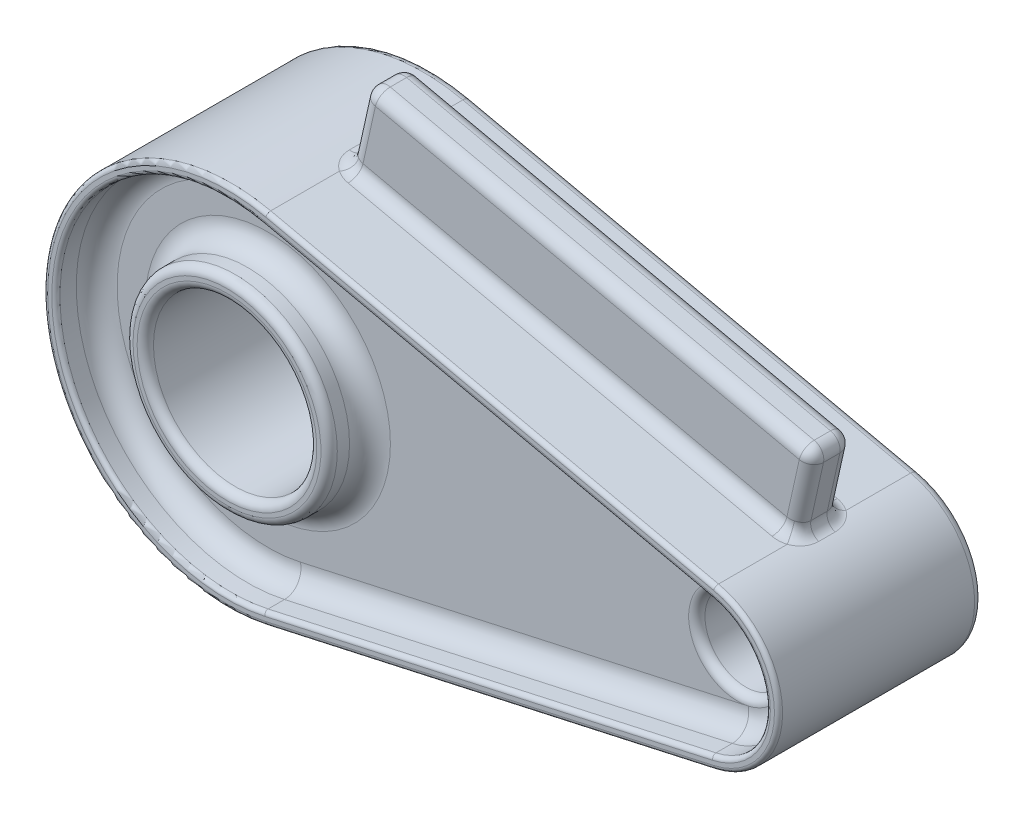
ISO-10303-21;
HEADER;
FILE_DESCRIPTION(('STEP AP214'),'2;1');
FILE_NAME('part.step','',(''),(''),'','','');
FILE_SCHEMA(('AUTOMOTIVE_DESIGN { 1 0 10303 214 1 1 1 1 }'));
ENDSEC;
DATA;
#1=APPLICATION_CONTEXT('core data for automotive mechanical design processes');
#2=APPLICATION_PROTOCOL_DEFINITION('international standard','automotive_design',2000,#1);
#3=PRODUCT_CONTEXT('',#1,'mechanical');
#4=PRODUCT('Part','Part','',(#3));
#5=PRODUCT_RELATED_PRODUCT_CATEGORY('part','',(#4));
#6=PRODUCT_DEFINITION_FORMATION('','',#4);
#7=PRODUCT_DEFINITION_CONTEXT('part definition',#1,'design');
#8=PRODUCT_DEFINITION('design','',#6,#7);
#9=PRODUCT_DEFINITION_SHAPE('','',#8);
#10=(LENGTH_UNIT() NAMED_UNIT(*) SI_UNIT(.MILLI.,.METRE.));
#11=(NAMED_UNIT(*) PLANE_ANGLE_UNIT() SI_UNIT($,.RADIAN.));
#12=(NAMED_UNIT(*) SI_UNIT($,.STERADIAN.) SOLID_ANGLE_UNIT());
#13=UNCERTAINTY_MEASURE_WITH_UNIT(LENGTH_MEASURE(1.E-05),#10,'distance_accuracy_value','');
#14=(GEOMETRIC_REPRESENTATION_CONTEXT(3) GLOBAL_UNCERTAINTY_ASSIGNED_CONTEXT((#13)) GLOBAL_UNIT_ASSIGNED_CONTEXT((#10,
#11,#12)) REPRESENTATION_CONTEXT('',''));
#15=CARTESIAN_POINT('',(0.,0.,0.));
#16=DIRECTION('',(0.,0.,1.));
#17=DIRECTION('',(1.,0.,0.));
#18=AXIS2_PLACEMENT_3D('',#15,#16,#17);
#19=CARTESIAN_POINT('',(-105.283905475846,43.8264701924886,25.));
#20=DIRECTION('',(-0.2164396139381,-0.976296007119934,0.));
#21=DIRECTION('',(0.976296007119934,-0.2164396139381,0.));
#22=AXIS2_PLACEMENT_3D('',#19,#20,#21);
#23=PLANE('',#22);
#24=DIRECTION('',(0.,0.,-1.));
#25=VECTOR('',#24,1.);
#26=CARTESIAN_POINT('',(4.328792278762,19.5259201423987,25.));
#27=LINE('',#26,#25);
#28=CARTESIAN_POINT('',(4.328792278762,19.5259201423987,24.));
#29=VERTEX_POINT('',#28);
#30=CARTESIAN_POINT('',(4.328792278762,19.5259201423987,7.19615242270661));
#31=VERTEX_POINT('',#30);
#32=EDGE_CURVE('E705',#29,#31,#27,.T.);
#33=ORIENTED_EDGE('',*,*,#32,.T.);
#34=CARTESIAN_POINT('',(1.3999042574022,20.175238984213,2.));
#35=DIRECTION('',(-0.2164396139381,-0.976296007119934,0.));
#36=DIRECTION('',(0.976296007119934,-0.2164396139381,0.));
#37=AXIS2_PLACEMENT_3D('',#34,#35,#36);
#38=CIRCLE('',#37,6.);
#39=CARTESIAN_POINT('',(1.3999042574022,20.175238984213,8.));
#40=VERTEX_POINT('',#39);
#41=EDGE_CURVE('E827',#31,#40,#38,.T.);
#42=ORIENTED_EDGE('',*,*,#41,.T.);
#43=DIRECTION('',(0.976296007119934,-0.2164396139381,0.));
#44=VECTOR('',#43,1.);
#45=CARTESIAN_POINT('',(-105.283905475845,43.8264701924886,8.));
#46=LINE('',#45,#44);
#47=CARTESIAN_POINT('',(-102.355017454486,43.1771513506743,8.));
#48=VERTEX_POINT('',#47);
#49=EDGE_CURVE('E825',#40,#48,#46,.F.);
#50=ORIENTED_EDGE('',*,*,#49,.T.);
#51=CARTESIAN_POINT('',(-102.355017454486,43.1771513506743,2.));
#52=DIRECTION('',(-0.2164396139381,-0.976296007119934,0.));
#53=DIRECTION('',(0.976296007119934,-0.2164396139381,0.));
#54=AXIS2_PLACEMENT_3D('',#51,#52,#53);
#55=CIRCLE('',#54,6.);
#56=CARTESIAN_POINT('',(-105.283905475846,43.8264701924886,7.1961524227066));
#57=VERTEX_POINT('',#56);
#58=EDGE_CURVE('E823',#48,#57,#55,.T.);
#59=ORIENTED_EDGE('',*,*,#58,.T.);
#60=DIRECTION('',(0.,0.,-1.));
#61=VECTOR('',#60,1.);
#62=CARTESIAN_POINT('',(-105.283905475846,43.8264701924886,25.));
#63=LINE('',#62,#61);
#64=CARTESIAN_POINT('',(-105.283905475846,43.8264701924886,24.));
#65=VERTEX_POINT('',#64);
#66=EDGE_CURVE('E566',#65,#57,#63,.T.);
#67=ORIENTED_EDGE('',*,*,#66,.F.);
#68=DIRECTION('',(-0.976296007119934,0.2164396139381,0.));
#69=VECTOR('',#68,1.);
#70=CARTESIAN_POINT('',(-105.283905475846,43.8264701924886,24.));
#71=LINE('',#70,#69);
#72=EDGE_CURVE('E758',#65,#29,#71,.F.);
#73=ORIENTED_EDGE('',*,*,#72,.T.);
#74=EDGE_LOOP('',(#33,#42,#50,#59,#67,#73));
#75=FACE_BOUND('',#74,.T.);
#76=ADVANCED_FACE('F35',(#75),#23,.F.);
#77=CARTESIAN_POINT('',(-2.63677968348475E-13,-1.52655665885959E-13,25.));
#78=DIRECTION('',(0.,0.,-1.));
#79=DIRECTION('',(-1.,0.,0.));
#80=AXIS2_PLACEMENT_3D('',#77,#78,#79);
#81=PLANE('',#80);
#82=CARTESIAN_POINT('',(-115.,0.,25.));
#83=DIRECTION('',(0.,0.,-1.));
#84=DIRECTION('',(-1.,0.,0.));
#85=AXIS2_PLACEMENT_3D('',#82,#83,#84);
#86=CIRCLE('',#85,22.);
#87=CARTESIAN_POINT('',(-137.,0.,25.));
#88=VERTEX_POINT('',#87);
#89=EDGE_CURVE('E808',#88,#88,#86,.T.);
#90=ORIENTED_EDGE('',*,*,#89,.T.);
#91=EDGE_LOOP('',(#90));
#92=FACE_BOUND('',#91,.T.);
#93=CARTESIAN_POINT('',(-115.,0.,25.));
#94=DIRECTION('',(0.,0.,-1.));
#95=DIRECTION('',(-1.,0.,0.));
#96=AXIS2_PLACEMENT_3D('',#93,#94,#95);
#97=CIRCLE('',#96,23.);
#98=CARTESIAN_POINT('',(-138.,0.,25.));
#99=VERTEX_POINT('',#98);
#100=EDGE_CURVE('E805',#99,#99,#97,.F.);
#101=ORIENTED_EDGE('',*,*,#100,.T.);
#102=EDGE_LOOP('',(#101));
#103=FACE_BOUND('',#102,.T.);
#104=ADVANCED_FACE('F531',(#92,#103),#81,.F.);
#105=CARTESIAN_POINT('',(-2.63677968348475E-13,-1.52655665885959E-13,25.));
#106=DIRECTION('',(0.,0.,-1.));
#107=DIRECTION('',(-1.,0.,0.));
#108=AXIS2_PLACEMENT_3D('',#105,#106,#107);
#109=CYLINDRICAL_SURFACE('',#108,10.);
#110=CARTESIAN_POINT('',(-2.63677968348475E-13,-1.52655665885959E-13,13.));
#111=DIRECTION('',(0.,0.,1.));
#112=DIRECTION('',(1.,0.,0.));
#113=AXIS2_PLACEMENT_3D('',#110,#111,#112);
#114=CIRCLE('',#113,10.);
#115=CARTESIAN_POINT('',(9.99999999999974,-1.52655665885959E-13,13.));
#116=VERTEX_POINT('',#115);
#117=EDGE_CURVE('E793',#116,#116,#114,.T.);
#118=ORIENTED_EDGE('',*,*,#117,.T.);
#119=EDGE_LOOP('',(#118));
#120=FACE_BOUND('',#119,.T.);
#121=CARTESIAN_POINT('',(-2.63677968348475E-13,-1.52655665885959E-13,-23.));
#122=DIRECTION('',(0.,0.,-1.));
#123=DIRECTION('',(-1.,0.,0.));
#124=AXIS2_PLACEMENT_3D('',#121,#122,#123);
#125=CIRCLE('',#124,10.);
#126=CARTESIAN_POINT('',(-10.0000000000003,-1.52655665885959E-13,-23.));
#127=VERTEX_POINT('',#126);
#128=EDGE_CURVE('E790',#127,#127,#125,.T.);
#129=ORIENTED_EDGE('',*,*,#128,.T.);
#130=EDGE_LOOP('',(#129));
#131=FACE_BOUND('',#130,.T.);
#132=ADVANCED_FACE('F527',(#120,#131),#109,.F.);
#133=CARTESIAN_POINT('',(-115.,0.,25.));
#134=DIRECTION('',(0.,0.,-1.));
#135=DIRECTION('',(-1.,0.,0.));
#136=AXIS2_PLACEMENT_3D('',#133,#134,#135);
#137=CIRCLE('',#136,43.8905556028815);
#138=CARTESIAN_POINT('',(-105.500345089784,42.8501741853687,25.));
#139=VERTEX_POINT('',#138);
#140=CARTESIAN_POINT('',(-105.500345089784,-42.8501741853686,25.));
#141=VERTEX_POINT('',#140);
#142=EDGE_CURVE('E744',#139,#141,#137,.F.);
#143=ORIENTED_EDGE('',*,*,#142,.T.);
#144=DIRECTION('',(0.976296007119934,0.2164396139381,0.));
#145=VECTOR('',#144,1.);
#146=CARTESIAN_POINT('',(4.11235266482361,-18.5496241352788,25.));
#147=LINE('',#146,#145);
#148=CARTESIAN_POINT('',(4.11235266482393,-18.5496241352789,25.));
#149=VERTEX_POINT('',#148);
#150=EDGE_CURVE('E746',#141,#149,#147,.T.);
#151=ORIENTED_EDGE('',*,*,#150,.T.);
#152=CARTESIAN_POINT('',(-2.63677968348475E-13,-1.52655665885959E-13,25.));
#153=DIRECTION('',(0.,0.,-1.));
#154=DIRECTION('',(-1.,0.,0.));
#155=AXIS2_PLACEMENT_3D('',#152,#153,#154);
#156=CIRCLE('',#155,19.0000000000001);
#157=CARTESIAN_POINT('',(4.11235266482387,18.5496241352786,25.));
#158=VERTEX_POINT('',#157);
#159=EDGE_CURVE('E740',#149,#158,#156,.F.);
#160=ORIENTED_EDGE('',*,*,#159,.T.);
#161=DIRECTION('',(-0.976296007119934,0.2164396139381,0.));
#162=VECTOR('',#161,1.);
#163=CARTESIAN_POINT('',(4.11235266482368,18.5496241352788,25.));
#164=LINE('',#163,#162);
#165=EDGE_CURVE('E742',#158,#139,#164,.T.);
#166=ORIENTED_EDGE('',*,*,#165,.T.);
#167=EDGE_LOOP('',(#143,#151,#160,#166));
#168=FACE_BOUND('',#167,.T.);
#169=DIRECTION('',(-0.976296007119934,0.216439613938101,0.));
#170=VECTOR('',#169,1.);
#171=CARTESIAN_POINT('',(3.89591305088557,17.5733281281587,25.));
#172=LINE('',#171,#170);
#173=CARTESIAN_POINT('',(-105.716784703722,41.8738781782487,25.));
#174=VERTEX_POINT('',#173);
#175=CARTESIAN_POINT('',(3.89591305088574,17.5733281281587,25.));
#176=VERTEX_POINT('',#175);
#177=EDGE_CURVE('E735',#174,#176,#172,.F.);
#178=ORIENTED_EDGE('',*,*,#177,.T.);
#179=CARTESIAN_POINT('',(-2.63677968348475E-13,-1.52655665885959E-13,25.));
#180=DIRECTION('',(0.,0.,-1.));
#181=DIRECTION('',(-1.,0.,0.));
#182=AXIS2_PLACEMENT_3D('',#179,#180,#181);
#183=CIRCLE('',#182,18.0000000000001);
#184=CARTESIAN_POINT('',(3.8959130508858,-17.573328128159,25.));
#185=VERTEX_POINT('',#184);
#186=EDGE_CURVE('E737',#176,#185,#183,.T.);
#187=ORIENTED_EDGE('',*,*,#186,.T.);
#188=DIRECTION('',(0.976296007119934,0.216439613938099,0.));
#189=VECTOR('',#188,1.);
#190=CARTESIAN_POINT('',(3.89591305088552,-17.573328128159,25.));
#191=LINE('',#190,#189);
#192=CARTESIAN_POINT('',(-105.716784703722,-41.8738781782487,25.));
#193=VERTEX_POINT('',#192);
#194=EDGE_CURVE('E731',#185,#193,#191,.F.);
#195=ORIENTED_EDGE('',*,*,#194,.T.);
#196=CARTESIAN_POINT('',(-115.,0.,25.));
#197=DIRECTION('',(0.,0.,-1.));
#198=DIRECTION('',(-1.,0.,0.));
#199=AXIS2_PLACEMENT_3D('',#196,#197,#198);
#200=CIRCLE('',#199,42.8905556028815);
#201=EDGE_CURVE('E733',#193,#174,#200,.T.);
#202=ORIENTED_EDGE('',*,*,#201,.T.);
#203=EDGE_LOOP('',(#178,#187,#195,#202));
#204=FACE_BOUND('',#203,.T.);
#205=ADVANCED_FACE('F530',(#168,#204),#81,.F.);
#206=CARTESIAN_POINT('',(-2.63677968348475E-13,-1.52655665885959E-13,-25.));
#207=DIRECTION('',(0.,0.,-1.));
#208=DIRECTION('',(-1.,0.,0.));
#209=AXIS2_PLACEMENT_3D('',#206,#207,#208);
#210=PLANE('',#209);
#211=CARTESIAN_POINT('',(-115.,0.,-25.));
#212=DIRECTION('',(0.,0.,-1.));
#213=DIRECTION('',(-1.,0.,0.));
#214=AXIS2_PLACEMENT_3D('',#211,#212,#213);
#215=CIRCLE('',#214,42.8905556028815);
#216=CARTESIAN_POINT('',(-105.716784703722,-41.8738781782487,-25.));
#217=VERTEX_POINT('',#216);
#218=CARTESIAN_POINT('',(-105.716784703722,41.8738781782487,-25.));
#219=VERTEX_POINT('',#218);
#220=EDGE_CURVE('E785',#217,#219,#215,.T.);
#221=ORIENTED_EDGE('',*,*,#220,.T.);
#222=DIRECTION('',(-0.976296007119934,0.2164396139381,0.));
#223=VECTOR('',#222,1.);
#224=CARTESIAN_POINT('',(3.89591305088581,17.5733281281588,-25.));
#225=LINE('',#224,#223);
#226=CARTESIAN_POINT('',(3.89591305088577,17.5733281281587,-25.));
#227=VERTEX_POINT('',#226);
#228=EDGE_CURVE('E787',#219,#227,#225,.F.);
#229=ORIENTED_EDGE('',*,*,#228,.T.);
#230=CARTESIAN_POINT('',(-2.63677968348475E-13,-1.52655665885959E-13,-25.));
#231=DIRECTION('',(0.,0.,-1.));
#232=DIRECTION('',(-1.,0.,0.));
#233=AXIS2_PLACEMENT_3D('',#230,#231,#232);
#234=CIRCLE('',#233,18.0000000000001);
#235=CARTESIAN_POINT('',(3.89591305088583,-17.573328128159,-25.));
#236=VERTEX_POINT('',#235);
#237=EDGE_CURVE('E781',#227,#236,#234,.T.);
#238=ORIENTED_EDGE('',*,*,#237,.T.);
#239=DIRECTION('',(0.976296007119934,0.2164396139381,0.));
#240=VECTOR('',#239,1.);
#241=CARTESIAN_POINT('',(-105.716784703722,-41.8738781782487,-25.));
#242=LINE('',#241,#240);
#243=EDGE_CURVE('E783',#236,#217,#242,.F.);
#244=ORIENTED_EDGE('',*,*,#243,.T.);
#245=EDGE_LOOP('',(#221,#229,#238,#244));
#246=FACE_BOUND('',#245,.T.);
#247=CARTESIAN_POINT('',(-2.63677968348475E-13,-1.52655665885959E-13,-25.));
#248=DIRECTION('',(0.,0.,-1.));
#249=DIRECTION('',(-1.,0.,0.));
#250=AXIS2_PLACEMENT_3D('',#247,#248,#249);
#251=CIRCLE('',#250,12.);
#252=CARTESIAN_POINT('',(-12.0000000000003,-1.52655665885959E-13,-25.));
#253=VERTEX_POINT('',#252);
#254=EDGE_CURVE('E778',#253,#253,#251,.F.);
#255=ORIENTED_EDGE('',*,*,#254,.T.);
#256=EDGE_LOOP('',(#255));
#257=FACE_BOUND('',#256,.T.);
#258=CARTESIAN_POINT('',(-115.,0.,-25.));
#259=DIRECTION('',(0.,0.,-1.));
#260=DIRECTION('',(-1.,0.,0.));
#261=AXIS2_PLACEMENT_3D('',#258,#259,#260);
#262=CIRCLE('',#261,22.);
#263=CARTESIAN_POINT('',(-137.,0.,-25.));
#264=VERTEX_POINT('',#263);
#265=EDGE_CURVE('E775',#264,#264,#262,.F.);
#266=ORIENTED_EDGE('',*,*,#265,.T.);
#267=EDGE_LOOP('',(#266));
#268=FACE_BOUND('',#267,.T.);
#269=ADVANCED_FACE('F536',(#246,#257,#268),#210,.T.);
#270=CARTESIAN_POINT('',(-2.63677968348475E-13,-1.52655665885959E-13,25.));
#271=DIRECTION('',(0.,0.,-1.));
#272=DIRECTION('',(-1.,0.,0.));
#273=AXIS2_PLACEMENT_3D('',#270,#271,#272);
#274=CYLINDRICAL_SURFACE('',#273,20.0000000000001);
#275=CARTESIAN_POINT('',(4.328792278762,19.5259201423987,-7.19615242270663));
#276=VERTEX_POINT('',#275);
#277=CARTESIAN_POINT('',(4.328792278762,19.5259201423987,-23.));
#278=VERTEX_POINT('',#277);
#279=EDGE_CURVE('E704',#276,#278,#27,.T.);
#280=ORIENTED_EDGE('',*,*,#279,.F.);
#281=CARTESIAN_POINT('',(4.78179820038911,22.3394575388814,-1.01391081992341));
#282=CARTESIAN_POINT('',(4.1674407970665,19.7247581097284,-0.916592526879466));
#283=CARTESIAN_POINT('',(6.56342994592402,18.8923632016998,-0.0278216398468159));
#284=CARTESIAN_POINT('',(4.80728285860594,22.3272125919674,-1.09299020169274));
#285=CARTESIAN_POINT('',(4.19953222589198,19.7200717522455,-1.00065696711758));
#286=CARTESIAN_POINT('',(6.60896292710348,18.8765338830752,-0.185980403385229));
#287=CARTESIAN_POINT('',(4.82965237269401,22.3162695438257,-1.17323583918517));
#288=CARTESIAN_POINT('',(4.22811087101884,19.7157809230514,-1.08714193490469));
#289=CARTESIAN_POINT('',(6.64896594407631,18.8624620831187,-0.346471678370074));
#290=CARTESIAN_POINT('',(4.86807693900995,22.2972530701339,-1.33548906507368));
#291=CARTESIAN_POINT('',(4.27757264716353,19.7082232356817,-1.26348834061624));
#292=CARTESIAN_POINT('',(6.71772024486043,18.8380909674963,-0.670978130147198));
#293=CARTESIAN_POINT('',(4.88413211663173,22.2891795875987,-1.41749661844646));
#294=CARTESIAN_POINT('',(4.29849099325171,19.7049513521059,-1.35340323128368));
#295=CARTESIAN_POINT('',(6.74647175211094,18.8277915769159,-0.834993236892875));
#296=CARTESIAN_POINT('',(4.90983270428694,22.2761737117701,-1.58262822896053));
#297=CARTESIAN_POINT('',(4.33209928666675,19.6996432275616,-1.53546869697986));
#298=CARTESIAN_POINT('',(6.79251128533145,18.8112299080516,-1.16525645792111));
#299=CARTESIAN_POINT('',(4.91948415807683,22.2712383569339,-1.66575115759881));
#300=CARTESIAN_POINT('',(4.34482276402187,19.6976018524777,-1.62768260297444));
#301=CARTESIAN_POINT('',(6.8098101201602,18.8049638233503,-1.33150231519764));
#302=CARTESIAN_POINT('',(4.93236088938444,22.2646356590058,-1.83256835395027));
#303=CARTESIAN_POINT('',(4.36182014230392,19.6948635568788,-1.81321334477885));
#304=CARTESIAN_POINT('',(6.83289311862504,18.7965873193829,-1.66513670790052));
#305=CARTESIAN_POINT('',(4.93558630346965,22.262968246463,-1.91626260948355));
#306=CARTESIAN_POINT('',(4.36610778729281,19.6941644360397,-1.90660312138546));
#307=CARTESIAN_POINT('',(6.83867752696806,18.7944768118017,-1.8325252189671));
#308=CARTESIAN_POINT('',(4.93557509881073,22.2629864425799,-2.16801537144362));
#309=CARTESIAN_POINT('',(4.366061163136,19.6941798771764,-2.18739713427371));
#310=CARTESIAN_POINT('',(6.83865515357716,18.7944954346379,-2.33603074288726));
#311=CARTESIAN_POINT('',(4.92256753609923,22.2697357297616,-2.33620439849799));
#312=CARTESIAN_POINT('',(4.34869527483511,19.6970272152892,-2.3752845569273));
#313=CARTESIAN_POINT('',(6.81532301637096,18.8030294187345,-2.67240879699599));
#314=CARTESIAN_POINT('',(4.87077577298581,22.2959320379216,-2.66765551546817));
#315=CARTESIAN_POINT('',(4.28100079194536,19.7077085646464,-2.7406765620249));
#316=CARTESIAN_POINT('',(6.72254666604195,18.8363925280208,-3.33531103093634));
#317=CARTESIAN_POINT('',(4.83199430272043,22.3153777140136,-2.83091812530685));
#318=CARTESIAN_POINT('',(4.23046463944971,19.7155746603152,-2.91871694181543));
#319=CARTESIAN_POINT('',(6.65310733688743,18.8612199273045,-3.66183625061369));
#320=CARTESIAN_POINT('',(4.72942677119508,22.3645812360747,-3.1479986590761));
#321=CARTESIAN_POINT('',(4.10128721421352,19.7343979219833,-3.2562906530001));
#322=CARTESIAN_POINT('',(6.46986618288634,18.9248564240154,-4.29599731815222));
#323=CARTESIAN_POINT('',(4.66564842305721,22.3943359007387,-3.30181947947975));
#324=CARTESIAN_POINT('',(4.02232169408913,19.7453965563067,-3.41614213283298));
#325=CARTESIAN_POINT('',(6.35607804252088,18.9636612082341,-4.60363895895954));
#326=CARTESIAN_POINT('',(4.51426571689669,22.4605970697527,-3.59580515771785));
#327=CARTESIAN_POINT('',(3.84331283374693,19.768093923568,-3.71168160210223));
#328=CARTESIAN_POINT('',(6.08679516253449,19.051794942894,-5.19161031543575));
#329=CARTESIAN_POINT('',(4.42665858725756,22.4971043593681,-3.73596842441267));
#330=CARTESIAN_POINT('',(3.7429553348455,19.7798160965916,-3.8473982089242));
#331=CARTESIAN_POINT('',(5.93129557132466,19.1011251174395,-5.47193684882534));
#332=CARTESIAN_POINT('',(4.22877122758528,22.5727138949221,-3.99947331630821));
#333=CARTESIAN_POINT('',(3.52878726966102,19.8019440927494,-4.09289316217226));
#334=CARTESIAN_POINT('',(5.58131169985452,19.2063137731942,-5.9989466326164));
#335=CARTESIAN_POINT('',(4.1183695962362,22.6118292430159,-4.12271873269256));
#336=CARTESIAN_POINT('',(3.41476049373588,19.812332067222,-4.20230518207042));
#337=CARTESIAN_POINT('',(5.38661882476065,19.262206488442,-6.24543746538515));
#338=CARTESIAN_POINT('',(3.87735133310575,22.6877245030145,-4.34801024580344));
#339=CARTESIAN_POINT('',(3.18150863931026,19.8307617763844,-4.39545671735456));
#340=CARTESIAN_POINT('',(4.96332915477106,19.3755804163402,-6.69602049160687));
#341=CARTESIAN_POINT('',(3.74673786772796,22.7245047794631,-4.45005965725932));
#342=CARTESIAN_POINT('',(3.06237993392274,19.8387716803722,-4.47885312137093));
#343=CARTESIAN_POINT('',(4.73473767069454,19.4330613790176,-6.90011931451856));
#344=CARTESIAN_POINT('',(3.53863499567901,22.7743263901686,-4.58455933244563));
#345=CARTESIAN_POINT('',(2.88451776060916,19.8494814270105,-4.58734478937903));
#346=CARTESIAN_POINT('',(4.37214228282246,19.5166523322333,-7.1691186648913));
#347=CARTESIAN_POINT('',(3.46749712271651,22.789998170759,-4.62618732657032));
#348=CARTESIAN_POINT('',(2.82547181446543,19.8528281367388,-4.62068528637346));
#349=CARTESIAN_POINT('',(4.24844245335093,19.5439897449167,-7.25237465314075));
#350=CARTESIAN_POINT('',(3.32142117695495,22.8191490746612,-4.70320641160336));
#351=CARTESIAN_POINT('',(2.70756495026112,19.8593314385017,-4.68273207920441));
#352=CARTESIAN_POINT('',(3.99499144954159,19.5973668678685,-7.40641282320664));
#353=CARTESIAN_POINT('',(3.24648314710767,22.8326282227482,-4.73859757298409));
#354=CARTESIAN_POINT('',(2.64875418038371,19.862484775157,-4.71139964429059));
#355=CARTESIAN_POINT('',(3.86524034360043,19.6234065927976,-7.47719514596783));
#356=CARTESIAN_POINT('',(3.09317512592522,22.8569560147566,-4.80291876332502));
#357=CARTESIAN_POINT('',(2.53123657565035,19.8688536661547,-4.76477386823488));
#358=CARTESIAN_POINT('',(3.60039265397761,19.6737221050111,-7.60583752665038));
#359=CARTESIAN_POINT('',(3.0147995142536,22.8678001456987,-4.83183770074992));
#360=CARTESIAN_POINT('',(2.47258919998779,19.8720662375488,-4.78943970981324));
#361=CARTESIAN_POINT('',(3.46528735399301,19.6979948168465,-7.66367540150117));
#362=CARTESIAN_POINT('',(2.85525796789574,22.8864733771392,-4.88295607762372));
#363=CARTESIAN_POINT('',(2.35510799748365,19.878801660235,-4.83524845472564));
#364=CARTESIAN_POINT('',(3.19089168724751,19.7443083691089,-7.76591215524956));
#365=CARTESIAN_POINT('',(2.77409162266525,22.8943020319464,-4.90515452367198));
#366=CARTESIAN_POINT('',(2.29633890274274,19.882321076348,-4.85636280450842));
#367=CARTESIAN_POINT('',(3.05160070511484,19.7663488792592,-7.81030904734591));
#368=CARTESIAN_POINT('',(2.6918029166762,22.9004438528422,-4.92389764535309));
#369=CARTESIAN_POINT('',(2.23729628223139,19.8861210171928,-4.87597578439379));
#370=CARTESIAN_POINT('',(2.91071346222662,19.7870600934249,-7.84779529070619));
#371=(BOUNDED_SURFACE() B_SPLINE_SURFACE(3,2,((#281,#282,#283),(#284,#285,#286),(#287,#288,
#289),(#290,#291,#292),(#293,#294,#295),(#296,#297,#298),(#299,#300,#301),(#302,#303,#304),
(#305,#306,#307),(#308,#309,#310),(#311,#312,#313),(#314,#315,#316),(#317,#318,#319),(#320,#321,
#322),(#323,#324,#325),(#326,#327,#328),(#329,#330,#331),(#332,#333,#334),(#335,#336,#337),
(#338,#339,#340),(#341,#342,#343),(#344,#345,#346),(#347,#348,#349),(#350,#351,#352),(#353,#354,
#355),(#356,#357,#358),(#359,#360,#361),(#362,#363,#364),(#365,#366,#367),(#368,#369,#370)),
.UNSPECIFIED.,.F.,.F.,.F.) B_SPLINE_SURFACE_WITH_KNOTS((4,2,2,2,2,2,2,2,2,2,2,2,2,2,4),(3,3),
(0.,0.502621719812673,1.00523345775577,1.50737015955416,2.00949618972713,3.01698986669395,
4.02437684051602,5.0314532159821,6.0386467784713,7.05134972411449,8.06389417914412,
8.56678547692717,9.06967109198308,9.57341201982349,10.0772273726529),(0.,1.),
.UNSPECIFIED.) GEOMETRIC_REPRESENTATION_ITEM() RATIONAL_B_SPLINE_SURFACE(((1.,0.744814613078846,
1.),(1.,0.745931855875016,1.),(1.,0.746931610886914,1.),(1.,0.748670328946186,1.),(1.,
0.749409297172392,1.),(1.,0.750600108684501,1.),(1.,0.751052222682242,1.),(1.,0.751657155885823,
1.),(1.,0.7518099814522,1.),(1.,0.751808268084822,1.),(1.,0.75118957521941,1.),(1.,
0.748791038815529,1.),(1.,0.747011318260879,1.),(1.,0.742522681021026,1.),(1.,0.739814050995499,
1.),(1.,0.733828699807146,1.),(1.,0.730551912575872,1.),(1.,0.723878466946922,1.),(1.,
0.720481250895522,1.),(1.,0.714121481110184,1.),(1.,0.711158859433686,1.),(1.,0.707454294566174,
1.),(1.,0.70634517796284,1.),(1.,0.704423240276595,1.),(1.,0.703610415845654,1.),(1.,
0.702332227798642,1.),(1.,0.701867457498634,1.),(1.,0.70132508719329,1.),(1.,0.70124754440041,
1.),(1.,0.70138241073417,1.))) REPRESENTATION_ITEM('') SURFACE());
#372=CARTESIAN_POINT('',(2.91071346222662,19.7870600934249,-7.84779529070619));
#373=CARTESIAN_POINT('',(3.05160070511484,19.7663488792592,-7.81030904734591));
#374=CARTESIAN_POINT('',(3.19089168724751,19.7443083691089,-7.76591215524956));
#375=CARTESIAN_POINT('',(3.46528735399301,19.6979948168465,-7.66367540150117));
#376=CARTESIAN_POINT('',(3.60039265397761,19.6737221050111,-7.60583752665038));
#377=CARTESIAN_POINT('',(3.86524034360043,19.6234065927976,-7.47719514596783));
#378=CARTESIAN_POINT('',(3.99499144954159,19.5973668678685,-7.40641282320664));
#379=CARTESIAN_POINT('',(4.24844245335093,19.5439897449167,-7.25237465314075));
#380=CARTESIAN_POINT('',(4.37214228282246,19.5166523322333,-7.1691186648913));
#381=CARTESIAN_POINT('',(4.73473767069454,19.4330613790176,-6.90011931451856));
#382=CARTESIAN_POINT('',(4.96332915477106,19.3755804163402,-6.69602049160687));
#383=CARTESIAN_POINT('',(5.38661882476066,19.262206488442,-6.24543746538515));
#384=CARTESIAN_POINT('',(5.58131169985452,19.2063137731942,-5.99894663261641));
#385=CARTESIAN_POINT('',(5.93129557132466,19.1011251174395,-5.47193684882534));
#386=CARTESIAN_POINT('',(6.08679516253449,19.051794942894,-5.19161031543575));
#387=CARTESIAN_POINT('',(6.35607804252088,18.9636612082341,-4.60363895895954));
#388=CARTESIAN_POINT('',(6.46986618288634,18.9248564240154,-4.29599731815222));
#389=CARTESIAN_POINT('',(6.65310733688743,18.8612199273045,-3.66183625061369));
#390=CARTESIAN_POINT('',(6.72254666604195,18.8363925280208,-3.33531103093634));
#391=CARTESIAN_POINT('',(6.81532301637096,18.8030294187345,-2.67240879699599));
#392=CARTESIAN_POINT('',(6.83865515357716,18.7944954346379,-2.33603074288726));
#393=CARTESIAN_POINT('',(6.83867752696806,18.7944768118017,-1.8325252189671));
#394=CARTESIAN_POINT('',(6.83289311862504,18.7965873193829,-1.66513670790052));
#395=CARTESIAN_POINT('',(6.8098101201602,18.8049638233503,-1.33150231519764));
#396=CARTESIAN_POINT('',(6.79251128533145,18.8112299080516,-1.16525645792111));
#397=CARTESIAN_POINT('',(6.74647175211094,18.8277915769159,-0.834993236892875));
#398=CARTESIAN_POINT('',(6.71772024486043,18.8380909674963,-0.670978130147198));
#399=CARTESIAN_POINT('',(6.64896594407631,18.8624620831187,-0.346471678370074));
#400=CARTESIAN_POINT('',(6.60896292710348,18.8765338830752,-0.185980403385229));
#401=CARTESIAN_POINT('',(6.56342994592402,18.8923632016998,-0.0278216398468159));
#402=B_SPLINE_CURVE_WITH_KNOTS('',3,(#372,#373,#374,#375,#376,#377,#378,#379,#380,#381,#382,
#383,#384,#385,#386,#387,#388,#389,#390,#391,#392,#393,#394,#395,#396,#397,#398,#399,#400,#401),
.UNSPECIFIED.,.F.,.F.,(4,2,2,2,2,2,2,2,2,2,2,2,2,2,4),(0.,0.503815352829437,1.00755628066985,
1.51044189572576,2.01333319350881,3.02587764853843,4.03858059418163,5.04577415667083,
6.05285053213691,7.06023750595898,8.0677311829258,8.56985721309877,9.07199391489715,
9.57460565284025,10.0772273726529),.UNSPECIFIED.);
#403=CARTESIAN_POINT('',(6.83867008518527,18.7944830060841,-2.));
#404=VERTEX_POINT('',#403);
#405=EDGE_CURVE('E844',#276,#404,#402,.T.);
#406=ORIENTED_EDGE('',*,*,#405,.T.);
#407=DIRECTION('',(0.,0.,-1.));
#408=VECTOR('',#407,1.);
#409=CARTESIAN_POINT('',(6.83867008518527,18.7944830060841,25.));
#410=LINE('',#409,#408);
#411=CARTESIAN_POINT('',(6.83867008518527,18.7944830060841,2.));
#412=VERTEX_POINT('',#411);
#413=EDGE_CURVE('E843',#404,#412,#410,.F.);
#414=ORIENTED_EDGE('',*,*,#413,.T.);
#415=CARTESIAN_POINT('',(6.56342994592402,18.8923632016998,0.0278216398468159));
#416=CARTESIAN_POINT('',(4.1674407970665,19.7247581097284,0.916592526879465));
#417=CARTESIAN_POINT('',(4.78179820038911,22.3394575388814,1.01391081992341));
#418=CARTESIAN_POINT('',(6.60896292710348,18.8765338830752,0.185980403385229));
#419=CARTESIAN_POINT('',(4.19953222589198,19.7200717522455,1.00065696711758));
#420=CARTESIAN_POINT('',(4.80728285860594,22.3272125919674,1.09299020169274));
#421=CARTESIAN_POINT('',(6.6489659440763,18.8624620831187,0.346471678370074));
#422=CARTESIAN_POINT('',(4.22811087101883,19.7157809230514,1.08714193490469));
#423=CARTESIAN_POINT('',(4.82965237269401,22.3162695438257,1.17323583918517));
#424=CARTESIAN_POINT('',(6.71772024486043,18.8380909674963,0.670978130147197));
#425=CARTESIAN_POINT('',(4.27757264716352,19.7082232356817,1.26348834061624));
#426=CARTESIAN_POINT('',(4.86807693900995,22.2972530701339,1.33548906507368));
#427=CARTESIAN_POINT('',(6.74647175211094,18.8277915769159,0.834993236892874));
#428=CARTESIAN_POINT('',(4.2984909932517,19.7049513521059,1.35340323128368));
#429=CARTESIAN_POINT('',(4.88413211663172,22.2891795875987,1.41749661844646));
#430=CARTESIAN_POINT('',(6.79251128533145,18.8112299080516,1.16525645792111));
#431=CARTESIAN_POINT('',(4.33209928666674,19.6996432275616,1.53546869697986));
#432=CARTESIAN_POINT('',(4.90983270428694,22.2761737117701,1.58262822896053));
#433=CARTESIAN_POINT('',(6.8098101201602,18.8049638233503,1.33150231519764));
#434=CARTESIAN_POINT('',(4.34482276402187,19.6976018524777,1.62768260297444));
#435=CARTESIAN_POINT('',(4.91948415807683,22.2712383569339,1.66575115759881));
#436=CARTESIAN_POINT('',(6.83289311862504,18.7965873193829,1.66513670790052));
#437=CARTESIAN_POINT('',(4.36182014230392,19.6948635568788,1.81321334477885));
#438=CARTESIAN_POINT('',(4.93236088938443,22.2646356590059,1.83256835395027));
#439=CARTESIAN_POINT('',(6.83867752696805,18.7944768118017,1.8325252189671));
#440=CARTESIAN_POINT('',(4.36610778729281,19.6941644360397,1.90660312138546));
#441=CARTESIAN_POINT('',(4.93558630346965,22.262968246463,1.91626260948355));
#442=CARTESIAN_POINT('',(6.83865515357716,18.7944954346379,2.33603074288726));
#443=CARTESIAN_POINT('',(4.36606116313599,19.6941798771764,2.18739713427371));
#444=CARTESIAN_POINT('',(4.93557509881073,22.2629864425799,2.16801537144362));
#445=CARTESIAN_POINT('',(6.81532301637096,18.8030294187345,2.67240879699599));
#446=CARTESIAN_POINT('',(4.3486952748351,19.6970272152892,2.3752845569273));
#447=CARTESIAN_POINT('',(4.92256753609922,22.2697357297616,2.33620439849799));
#448=CARTESIAN_POINT('',(6.72254666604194,18.8363925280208,3.33531103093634));
#449=CARTESIAN_POINT('',(4.28100079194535,19.7077085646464,2.7406765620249));
#450=CARTESIAN_POINT('',(4.8707757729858,22.2959320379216,2.66765551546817));
#451=CARTESIAN_POINT('',(6.65310733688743,18.8612199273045,3.66183625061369));
#452=CARTESIAN_POINT('',(4.23046463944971,19.7155746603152,2.91871694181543));
#453=CARTESIAN_POINT('',(4.83199430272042,22.3153777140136,2.83091812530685));
#454=CARTESIAN_POINT('',(6.46986618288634,18.9248564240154,4.29599731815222));
#455=CARTESIAN_POINT('',(4.10128721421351,19.7343979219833,3.2562906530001));
#456=CARTESIAN_POINT('',(4.72942677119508,22.3645812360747,3.1479986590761));
#457=CARTESIAN_POINT('',(6.35607804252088,18.9636612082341,4.60363895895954));
#458=CARTESIAN_POINT('',(4.02232169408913,19.7453965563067,3.41614213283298));
#459=CARTESIAN_POINT('',(4.66564842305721,22.3943359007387,3.30181947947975));
#460=CARTESIAN_POINT('',(6.08679516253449,19.051794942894,5.19161031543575));
#461=CARTESIAN_POINT('',(3.84331283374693,19.768093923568,3.71168160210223));
#462=CARTESIAN_POINT('',(4.51426571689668,22.4605970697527,3.59580515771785));
#463=CARTESIAN_POINT('',(5.93129557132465,19.1011251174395,5.47193684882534));
#464=CARTESIAN_POINT('',(3.74295533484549,19.7798160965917,3.8473982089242));
#465=CARTESIAN_POINT('',(4.42665858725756,22.4971043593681,3.73596842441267));
#466=CARTESIAN_POINT('',(5.58131169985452,19.2063137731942,5.9989466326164));
#467=CARTESIAN_POINT('',(3.52878726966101,19.8019440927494,4.09289316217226));
#468=CARTESIAN_POINT('',(4.22877122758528,22.5727138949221,3.99947331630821));
#469=CARTESIAN_POINT('',(5.38661882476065,19.262206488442,6.24543746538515));
#470=CARTESIAN_POINT('',(3.41476049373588,19.812332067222,4.20230518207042));
#471=CARTESIAN_POINT('',(4.1183695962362,22.6118292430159,4.12271873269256));
#472=CARTESIAN_POINT('',(4.96332915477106,19.3755804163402,6.69602049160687));
#473=CARTESIAN_POINT('',(3.18150863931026,19.8307617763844,4.39545671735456));
#474=CARTESIAN_POINT('',(3.87735133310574,22.6877245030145,4.34801024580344));
#475=CARTESIAN_POINT('',(4.73473767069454,19.4330613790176,6.90011931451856));
#476=CARTESIAN_POINT('',(3.06237993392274,19.8387716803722,4.47885312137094));
#477=CARTESIAN_POINT('',(3.74673786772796,22.7245047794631,4.45005965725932));
#478=CARTESIAN_POINT('',(4.37214228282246,19.5166523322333,7.1691186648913));
#479=CARTESIAN_POINT('',(2.88451776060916,19.8494814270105,4.58734478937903));
#480=CARTESIAN_POINT('',(3.53863499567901,22.7743263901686,4.58455933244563));
#481=CARTESIAN_POINT('',(4.24844245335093,19.5439897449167,7.25237465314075));
#482=CARTESIAN_POINT('',(2.82547181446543,19.8528281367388,4.62068528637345));
#483=CARTESIAN_POINT('',(3.4674971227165,22.789998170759,4.62618732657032));
#484=CARTESIAN_POINT('',(3.99499144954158,19.5973668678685,7.40641282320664));
#485=CARTESIAN_POINT('',(2.70756495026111,19.8593314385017,4.68273207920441));
#486=CARTESIAN_POINT('',(3.32142117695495,22.8191490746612,4.70320641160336));
#487=CARTESIAN_POINT('',(3.86524034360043,19.6234065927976,7.47719514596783));
#488=CARTESIAN_POINT('',(2.6487541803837,19.862484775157,4.71139964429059));
#489=CARTESIAN_POINT('',(3.24648314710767,22.8326282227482,4.73859757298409));
#490=CARTESIAN_POINT('',(3.6003926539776,19.6737221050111,7.60583752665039));
#491=CARTESIAN_POINT('',(2.53123657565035,19.8688536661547,4.76477386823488));
#492=CARTESIAN_POINT('',(3.09317512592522,22.8569560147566,4.80291876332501));
#493=CARTESIAN_POINT('',(3.46528735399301,19.6979948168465,7.66367540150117));
#494=CARTESIAN_POINT('',(2.47258919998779,19.8720662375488,4.78943970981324));
#495=CARTESIAN_POINT('',(3.01479951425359,22.8678001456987,4.83183770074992));
#496=CARTESIAN_POINT('',(3.19089168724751,19.7443083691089,7.76591215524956));
#497=CARTESIAN_POINT('',(2.35510799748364,19.878801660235,4.83524845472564));
#498=CARTESIAN_POINT('',(2.85525796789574,22.8864733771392,4.88295607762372));
#499=CARTESIAN_POINT('',(3.05160070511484,19.7663488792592,7.81030904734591));
#500=CARTESIAN_POINT('',(2.29633890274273,19.882321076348,4.85636280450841));
#501=CARTESIAN_POINT('',(2.77409162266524,22.8943020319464,4.90515452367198));
#502=CARTESIAN_POINT('',(2.91071346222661,19.7870600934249,7.84779529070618));
#503=CARTESIAN_POINT('',(2.23729628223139,19.8861210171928,4.87597578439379));
#504=CARTESIAN_POINT('',(2.6918029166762,22.9004438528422,4.92389764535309));
#505=(BOUNDED_SURFACE() B_SPLINE_SURFACE(3,2,((#415,#416,#417),(#418,#419,#420),(#421,#422,
#423),(#424,#425,#426),(#427,#428,#429),(#430,#431,#432),(#433,#434,#435),(#436,#437,#438),
(#439,#440,#441),(#442,#443,#444),(#445,#446,#447),(#448,#449,#450),(#451,#452,#453),(#454,#455,
#456),(#457,#458,#459),(#460,#461,#462),(#463,#464,#465),(#466,#467,#468),(#469,#470,#471),
(#472,#473,#474),(#475,#476,#477),(#478,#479,#480),(#481,#482,#483),(#484,#485,#486),(#487,#488,
#489),(#490,#491,#492),(#493,#494,#495),(#496,#497,#498),(#499,#500,#501),(#502,#503,#504)),
.UNSPECIFIED.,.F.,.F.,.F.) B_SPLINE_SURFACE_WITH_KNOTS((4,2,2,2,2,2,2,2,2,2,2,2,2,2,4),(3,3),
(0.,0.502621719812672,1.00523345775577,1.50737015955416,2.00949618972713,3.01698986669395,
4.02437684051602,5.0314532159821,6.0386467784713,7.0513497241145,8.06389417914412,
8.56678547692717,9.06967109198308,9.57341201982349,10.0772273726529),(0.,1.),
.UNSPECIFIED.) GEOMETRIC_REPRESENTATION_ITEM() RATIONAL_B_SPLINE_SURFACE(((1.,0.744814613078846,
1.),(1.,0.745931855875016,1.),(1.,0.746931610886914,1.),(1.,0.748670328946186,1.),(1.,
0.749409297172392,1.),(1.,0.750600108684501,1.),(1.,0.751052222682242,1.),(1.,0.751657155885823,
1.),(1.,0.7518099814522,1.),(1.,0.751808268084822,1.),(1.,0.75118957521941,1.),(1.,
0.748791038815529,1.),(1.,0.747011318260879,1.),(1.,0.742522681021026,1.),(1.,0.739814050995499,
1.),(1.,0.733828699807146,1.),(1.,0.730551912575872,1.),(1.,0.723878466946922,1.),(1.,
0.720481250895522,1.),(1.,0.714121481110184,1.),(1.,0.711158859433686,1.),(1.,0.707454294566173,
1.),(1.,0.706345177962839,1.),(1.,0.704423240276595,1.),(1.,0.703610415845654,1.),(1.,
0.702332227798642,1.),(1.,0.701867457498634,1.),(1.,0.70132508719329,1.),(1.,0.70124754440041,
1.),(1.,0.70138241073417,1.))) REPRESENTATION_ITEM('') SURFACE());
#506=CARTESIAN_POINT('',(6.56342994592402,18.8923632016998,0.0278216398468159));
#507=CARTESIAN_POINT('',(6.60896292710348,18.8765338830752,0.185980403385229));
#508=CARTESIAN_POINT('',(6.6489659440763,18.8624620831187,0.346471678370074));
#509=CARTESIAN_POINT('',(6.71772024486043,18.8380909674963,0.670978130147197));
#510=CARTESIAN_POINT('',(6.74647175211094,18.8277915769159,0.834993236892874));
#511=CARTESIAN_POINT('',(6.79251128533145,18.8112299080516,1.16525645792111));
#512=CARTESIAN_POINT('',(6.8098101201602,18.8049638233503,1.33150231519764));
#513=CARTESIAN_POINT('',(6.83289311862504,18.7965873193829,1.66513670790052));
#514=CARTESIAN_POINT('',(6.83867752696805,18.7944768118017,1.8325252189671));
#515=CARTESIAN_POINT('',(6.83865515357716,18.7944954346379,2.33603074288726));
#516=CARTESIAN_POINT('',(6.81532301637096,18.8030294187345,2.67240879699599));
#517=CARTESIAN_POINT('',(6.72254666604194,18.8363925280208,3.33531103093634));
#518=CARTESIAN_POINT('',(6.65310733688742,18.8612199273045,3.66183625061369));
#519=CARTESIAN_POINT('',(6.46986618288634,18.9248564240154,4.29599731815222));
#520=CARTESIAN_POINT('',(6.35607804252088,18.9636612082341,4.60363895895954));
#521=CARTESIAN_POINT('',(6.08679516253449,19.051794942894,5.19161031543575));
#522=CARTESIAN_POINT('',(5.93129557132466,19.1011251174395,5.47193684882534));
#523=CARTESIAN_POINT('',(5.58131169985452,19.2063137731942,5.9989466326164));
#524=CARTESIAN_POINT('',(5.38661882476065,19.262206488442,6.24543746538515));
#525=CARTESIAN_POINT('',(4.96332915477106,19.3755804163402,6.69602049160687));
#526=CARTESIAN_POINT('',(4.73473767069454,19.4330613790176,6.90011931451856));
#527=CARTESIAN_POINT('',(4.37214228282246,19.5166523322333,7.1691186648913));
#528=CARTESIAN_POINT('',(4.24844245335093,19.5439897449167,7.25237465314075));
#529=CARTESIAN_POINT('',(3.99499144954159,19.5973668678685,7.40641282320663));
#530=CARTESIAN_POINT('',(3.86524034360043,19.6234065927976,7.47719514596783));
#531=CARTESIAN_POINT('',(3.60039265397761,19.6737221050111,7.60583752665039));
#532=CARTESIAN_POINT('',(3.46528735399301,19.6979948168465,7.66367540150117));
#533=CARTESIAN_POINT('',(3.19089168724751,19.7443083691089,7.76591215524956));
#534=CARTESIAN_POINT('',(3.05160070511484,19.7663488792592,7.81030904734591));
#535=CARTESIAN_POINT('',(2.91071346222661,19.7870600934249,7.84779529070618));
#536=B_SPLINE_CURVE_WITH_KNOTS('',3,(#506,#507,#508,#509,#510,#511,#512,#513,#514,#515,#516,
#517,#518,#519,#520,#521,#522,#523,#524,#525,#526,#527,#528,#529,#530,#531,#532,#533,#534,#535),
.UNSPECIFIED.,.F.,.F.,(4,2,2,2,2,2,2,2,2,2,2,2,2,2,4),(0.,0.502621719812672,1.00523345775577,
1.50737015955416,2.00949618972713,3.01698986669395,4.02437684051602,5.0314532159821,
6.0386467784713,7.0513497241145,8.06389417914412,8.56678547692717,9.06967109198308,
9.57341201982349,10.0772273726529),.UNSPECIFIED.);
#537=EDGE_CURVE('E838',#412,#31,#536,.T.);
#538=ORIENTED_EDGE('',*,*,#537,.T.);
#539=ORIENTED_EDGE('',*,*,#32,.F.);
#540=CARTESIAN_POINT('',(-2.63677968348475E-13,-1.52655665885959E-13,24.));
#541=DIRECTION('',(0.,0.,-1.));
#542=DIRECTION('',(-1.,0.,0.));
#543=AXIS2_PLACEMENT_3D('',#540,#541,#542);
#544=CIRCLE('',#543,20.0000000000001);
#545=CARTESIAN_POINT('',(4.328792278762,-19.5259201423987,24.));
#546=VERTEX_POINT('',#545);
#547=EDGE_CURVE('E763',#29,#546,#544,.T.);
#548=ORIENTED_EDGE('',*,*,#547,.T.);
#549=DIRECTION('',(0.,0.,-1.));
#550=VECTOR('',#549,1.);
#551=CARTESIAN_POINT('',(4.328792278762,-19.5259201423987,25.));
#552=LINE('',#551,#550);
#553=CARTESIAN_POINT('',(4.328792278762,-19.5259201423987,-23.));
#554=VERTEX_POINT('',#553);
#555=EDGE_CURVE('E690',#546,#554,#552,.T.);
#556=ORIENTED_EDGE('',*,*,#555,.T.);
#557=CARTESIAN_POINT('',(-2.63677968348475E-13,-1.52655665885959E-13,-23.));
#558=DIRECTION('',(0.,0.,-1.));
#559=DIRECTION('',(-1.,0.,0.));
#560=AXIS2_PLACEMENT_3D('',#557,#558,#559);
#561=CIRCLE('',#560,20.0000000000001);
#562=EDGE_CURVE('E760',#554,#278,#561,.F.);
#563=ORIENTED_EDGE('',*,*,#562,.T.);
#564=EDGE_LOOP('',(#280,#406,#414,#538,#539,#548,#556,#563));
#565=FACE_BOUND('',#564,.T.);
#566=ADVANCED_FACE('F361',(#565),#274,.T.);
#567=CARTESIAN_POINT('',(-105.283905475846,43.8264701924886,-7.1961524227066));
#568=VERTEX_POINT('',#567);
#569=CARTESIAN_POINT('',(-105.283905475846,43.8264701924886,-23.));
#570=VERTEX_POINT('',#569);
#571=EDGE_CURVE('E559',#568,#570,#63,.T.);
#572=ORIENTED_EDGE('',*,*,#571,.F.);
#573=CARTESIAN_POINT('',(-102.355017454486,43.1771513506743,-2.));
#574=DIRECTION('',(-0.2164396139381,-0.976296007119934,0.));
#575=DIRECTION('',(0.976296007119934,-0.2164396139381,0.));
#576=AXIS2_PLACEMENT_3D('',#573,#574,#575);
#577=CIRCLE('',#576,6.);
#578=CARTESIAN_POINT('',(-102.355017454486,43.1771513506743,-8.));
#579=VERTEX_POINT('',#578);
#580=EDGE_CURVE('E561',#568,#579,#577,.T.);
#581=ORIENTED_EDGE('',*,*,#580,.T.);
#582=DIRECTION('',(0.976296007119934,-0.2164396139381,0.));
#583=VECTOR('',#582,1.);
#584=CARTESIAN_POINT('',(-105.283905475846,43.8264701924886,-8.));
#585=LINE('',#584,#583);
#586=CARTESIAN_POINT('',(1.3999042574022,20.175238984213,-8.));
#587=VERTEX_POINT('',#586);
#588=EDGE_CURVE('E577',#579,#587,#585,.T.);
#589=ORIENTED_EDGE('',*,*,#588,.T.);
#590=CARTESIAN_POINT('',(1.3999042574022,20.175238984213,-2.));
#591=DIRECTION('',(-0.2164396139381,-0.976296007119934,0.));
#592=DIRECTION('',(0.976296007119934,-0.2164396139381,0.));
#593=AXIS2_PLACEMENT_3D('',#590,#591,#592);
#594=CIRCLE('',#593,6.);
#595=EDGE_CURVE('E857',#587,#276,#594,.T.);
#596=ORIENTED_EDGE('',*,*,#595,.T.);
#597=ORIENTED_EDGE('',*,*,#279,.T.);
#598=DIRECTION('',(-0.976296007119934,0.2164396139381,0.));
#599=VECTOR('',#598,1.);
#600=CARTESIAN_POINT('',(-105.283905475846,43.8264701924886,-23.));
#601=LINE('',#600,#599);
#602=EDGE_CURVE('E564',#278,#570,#601,.T.);
#603=ORIENTED_EDGE('',*,*,#602,.T.);
#604=EDGE_LOOP('',(#572,#581,#589,#596,#597,#603));
#605=FACE_BOUND('',#604,.T.);
#606=ADVANCED_FACE('F314',(#605),#23,.F.);
#607=CARTESIAN_POINT('',(-115.,0.,25.));
#608=DIRECTION('',(0.,0.,-1.));
#609=DIRECTION('',(-1.,0.,0.));
#610=AXIS2_PLACEMENT_3D('',#607,#608,#609);
#611=CYLINDRICAL_SURFACE('',#610,44.8905556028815);
#612=ORIENTED_EDGE('',*,*,#66,.T.);
#613=CARTESIAN_POINT('',(-104.486065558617,46.6465422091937,1.00858395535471));
#614=CARTESIAN_POINT('',(-105.08515395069,43.864255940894,0.959149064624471));
#615=CARTESIAN_POINT('',(-107.735853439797,44.2989182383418,0.0171679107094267));
#616=CARTESIAN_POINT('',(-104.513922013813,46.6495354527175,1.08808096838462));
#617=CARTESIAN_POINT('',(-105.114399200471,43.8722193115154,1.04108637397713));
#618=CARTESIAN_POINT('',(-107.78744599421,44.3073730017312,0.176161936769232));
#619=CARTESIAN_POINT('',(-104.538432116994,46.652082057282,1.16875489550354));
#620=CARTESIAN_POINT('',(-105.140321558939,43.8792441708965,1.12486531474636));
#621=CARTESIAN_POINT('',(-107.832823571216,44.3147266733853,0.337509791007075));
#622=CARTESIAN_POINT('',(-104.580599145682,46.6563654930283,1.33187631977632));
#623=CARTESIAN_POINT('',(-105.185091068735,43.8913385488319,1.29506866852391));
#624=CARTESIAN_POINT('',(-107.910871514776,44.3272819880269,0.66375263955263));
#625=CARTESIAN_POINT('',(-104.598256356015,46.658102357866,1.41432374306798));
#626=CARTESIAN_POINT('',(-105.203954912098,43.8964126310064,1.38152006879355));
#627=CARTESIAN_POINT('',(-107.943542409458,44.3324837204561,0.828647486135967));
#628=CARTESIAN_POINT('',(-104.626547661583,46.6608489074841,1.58034932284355));
#629=CARTESIAN_POINT('',(-105.234238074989,43.9045433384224,1.55616633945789));
#630=CARTESIAN_POINT('',(-107.995882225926,44.3407825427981,1.1606986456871));
#631=CARTESIAN_POINT('',(-104.637187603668,46.6618591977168,1.66392647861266));
#632=CARTESIAN_POINT('',(-105.245675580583,43.9076048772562,1.64439236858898));
#633=CARTESIAN_POINT('',(-108.015561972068,44.3438813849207,1.32785295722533));
#634=CARTESIAN_POINT('',(-104.651388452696,46.6631996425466,1.83165471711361));
#635=CARTESIAN_POINT('',(-105.260951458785,43.9116905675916,1.8217131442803));
#636=CARTESIAN_POINT('',(-108.041826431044,44.3480095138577,1.66330943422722));
#637=CARTESIAN_POINT('',(-104.654949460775,46.6635298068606,1.91580579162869));
#638=CARTESIAN_POINT('',(-105.264796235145,43.9127164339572,1.91084394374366));
#639=CARTESIAN_POINT('',(-108.048411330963,44.3490388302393,1.83161158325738));
#640=CARTESIAN_POINT('',(-104.654933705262,46.6635337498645,2.16846080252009));
#641=CARTESIAN_POINT('',(-105.264764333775,43.912710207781,2.17838898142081));
#642=CARTESIAN_POINT('',(-108.048383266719,44.3490395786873,2.33692160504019));
#643=CARTESIAN_POINT('',(-104.640645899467,46.6622198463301,2.33709428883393));
#644=CARTESIAN_POINT('',(-105.249303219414,43.9085894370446,2.35710504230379));
#645=CARTESIAN_POINT('',(-108.021964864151,44.3449202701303,2.67418857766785));
#646=CARTESIAN_POINT('',(-104.583949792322,46.6567111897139,2.66945433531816));
#647=CARTESIAN_POINT('',(-105.188629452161,43.8922966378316,2.7067087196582));
#648=CARTESIAN_POINT('',(-107.917074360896,44.3282848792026,3.33890867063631));
#649=CARTESIAN_POINT('',(-104.541544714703,46.6525167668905,2.83318145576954));
#650=CARTESIAN_POINT('',(-105.143323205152,43.8800993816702,2.87786187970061));
#651=CARTESIAN_POINT('',(-107.838608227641,44.3157697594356,3.66636291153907));
#652=CARTESIAN_POINT('',(-104.430036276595,46.6405084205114,3.15122044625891));
#653=CARTESIAN_POINT('',(-105.026227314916,43.8482062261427,3.20596287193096));
#654=CARTESIAN_POINT('',(-107.632079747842,44.2818996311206,4.30244089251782));
#655=CARTESIAN_POINT('',(-104.360933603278,46.6326945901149,3.30553255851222));
#656=CARTESIAN_POINT('',(-104.954282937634,43.8284673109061,3.36307437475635));
#657=CARTESIAN_POINT('',(-107.504018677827,44.2605448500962,4.61106511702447));
#658=CARTESIAN_POINT('',(-104.198268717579,46.6123508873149,3.60036773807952));
#659=CARTESIAN_POINT('',(-104.788595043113,43.7823850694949,3.65812708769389));
#660=CARTESIAN_POINT('',(-107.202181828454,44.2083628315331,5.20073547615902));
#661=CARTESIAN_POINT('',(-104.104705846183,46.5998208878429,3.74089043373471));
#662=CARTESIAN_POINT('',(-104.694699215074,43.7559971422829,3.79609971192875));
#663=CARTESIAN_POINT('',(-107.028404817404,44.1775353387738,5.48178086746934));
#664=CARTESIAN_POINT('',(-103.896019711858,46.568758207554,4.00433466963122));
#665=CARTESIAN_POINT('',(-104.490349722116,43.6978062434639,4.05004629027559));
#666=CARTESIAN_POINT('',(-106.640189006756,44.1057195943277,6.00866933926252));
#667=CARTESIAN_POINT('',(-103.780870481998,46.5502182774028,4.12723469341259));
#668=CARTESIAN_POINT('',(-104.379791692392,43.6659695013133,4.16590352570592));
#669=CARTESIAN_POINT('',(-106.425701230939,44.0647190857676,6.2544693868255));
#670=CARTESIAN_POINT('',(-103.532619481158,46.5058725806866,4.35179852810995));
#671=CARTESIAN_POINT('',(-104.14718285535,43.5983087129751,4.3744893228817));
#672=CARTESIAN_POINT('',(-105.962418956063,43.9720324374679,6.70359705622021));
#673=CARTESIAN_POINT('',(-103.399516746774,46.4800664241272,4.45346119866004));
#674=CARTESIAN_POINT('',(-104.025155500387,43.5624886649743,4.46705033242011));
#675=CARTESIAN_POINT('',(-105.713622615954,43.9203457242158,6.90692239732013));
#676=CARTESIAN_POINT('',(-103.189899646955,46.4352806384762,4.58763788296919));
#677=CARTESIAN_POINT('',(-103.836851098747,43.5069592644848,4.58868188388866));
#678=CARTESIAN_POINT('',(-105.320984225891,43.8348795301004,7.17527576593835));
#679=CARTESIAN_POINT('',(-103.118414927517,46.4193512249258,4.62929008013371));
#680=CARTESIAN_POINT('',(-103.773195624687,43.4881464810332,4.62635449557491));
#681=CARTESIAN_POINT('',(-105.18695462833,43.805089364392,7.25858016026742));
#682=CARTESIAN_POINT('',(-102.972575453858,46.3853811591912,4.70630211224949));
#683=CARTESIAN_POINT('',(-103.644297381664,43.4500265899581,4.69622354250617));
#684=CARTESIAN_POINT('',(-104.913222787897,43.7428688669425,7.41260422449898));
#685=CARTESIAN_POINT('',(-102.898220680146,46.3673404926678,4.74166190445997));
#686=CARTESIAN_POINT('',(-103.579079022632,43.4307266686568,4.72839845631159));
#687=CARTESIAN_POINT('',(-104.773520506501,43.7104385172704,7.48332380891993));
#688=CARTESIAN_POINT('',(-102.747157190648,46.3290914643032,4.80584617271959));
#689=CARTESIAN_POINT('',(-103.447253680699,43.3917479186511,4.7874389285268));
#690=CARTESIAN_POINT('',(-104.489376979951,43.6429844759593,7.61169234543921));
#691=CARTESIAN_POINT('',(-102.670446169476,46.3088809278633,4.83466400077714));
#692=CARTESIAN_POINT('',(-103.380676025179,43.3720778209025,4.81428025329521));
#693=CARTESIAN_POINT('',(-104.344931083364,43.6079581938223,7.66932800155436));
#694=CARTESIAN_POINT('',(-102.515319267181,46.2663196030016,4.88553110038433));
#695=CARTESIAN_POINT('',(-103.246300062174,43.3324584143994,4.86273276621));
#696=CARTESIAN_POINT('',(-104.052494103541,43.5354677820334,7.77106220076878));
#697=CARTESIAN_POINT('',(-102.436903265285,46.2439686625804,4.9075798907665));
#698=CARTESIAN_POINT('',(-103.178537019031,43.3125195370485,4.88432884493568));
#699=CARTESIAN_POINT('',(-103.904502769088,43.4980034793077,7.8151597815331));
#700=CARTESIAN_POINT('',(-102.357928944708,46.2205551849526,4.92614834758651));
#701=CARTESIAN_POINT('',(-103.110226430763,43.2924845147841,4.90337838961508));
#702=CARTESIAN_POINT('',(-103.755278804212,43.4593859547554,7.85229669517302));
#703=(BOUNDED_SURFACE() B_SPLINE_SURFACE(3,2,((#613,#614,#615),(#616,#617,#618),(#619,#620,
#621),(#622,#623,#624),(#625,#626,#627),(#628,#629,#630),(#631,#632,#633),(#634,#635,#636),
(#637,#638,#639),(#640,#641,#642),(#643,#644,#645),(#646,#647,#648),(#649,#650,#651),(#652,#653,
#654),(#655,#656,#657),(#658,#659,#660),(#661,#662,#663),(#664,#665,#666),(#667,#668,#669),
(#670,#671,#672),(#673,#674,#675),(#676,#677,#678),(#679,#680,#681),(#682,#683,#684),(#685,#686,
#687),(#688,#689,#690),(#691,#692,#693),(#694,#695,#696),(#697,#698,#699),(#700,#701,#702)),
.UNSPECIFIED.,.F.,.F.,.F.) B_SPLINE_SURFACE_WITH_KNOTS((4,2,2,2,2,2,2,2,2,2,2,2,2,2,4),(3,3),
(0.,0.505316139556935,1.0106112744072,1.51548485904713,2.02035123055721,3.03051803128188,
4.04056903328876,5.05059403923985,6.06064626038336,7.07192139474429,8.08325081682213,
8.58827984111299,9.09331229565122,9.59885569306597,10.1044350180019),(0.,1.),
.UNSPECIFIED.) GEOMETRIC_REPRESENTATION_ITEM() RATIONAL_B_SPLINE_SURFACE(((1.,0.725423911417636,
1.),(1.,0.725980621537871,1.),(1.,0.726479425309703,1.),(1.,0.727347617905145,1.),(1.,
0.727717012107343,1.),(1.,0.728312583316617,1.),(1.,0.728538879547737,1.),(1.,0.728841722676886,
1.),(1.,0.728918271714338,1.),(1.,0.728917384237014,1.),(1.,0.72860914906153,1.),(1.,
0.727416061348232,1.),(1.,0.726531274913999,1.),(1.,0.724305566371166,1.),(1.,0.722964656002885,
1.),(1.,0.720013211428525,1.),(1.,0.718402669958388,1.),(1.,0.715145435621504,1.),(1.,
0.713498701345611,1.),(1.,0.710429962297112,1.),(1.,0.709007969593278,1.),(1.,0.707233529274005,
1.),(1.,0.706702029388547,1.),(1.,0.705783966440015,1.),(1.,0.705397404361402,1.),(1.,
0.704793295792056,1.),(1.,0.704575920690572,1.),(1.,0.70432864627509,1.),(1.,0.704298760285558,
1.),(1.,0.704371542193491,1.))) REPRESENTATION_ITEM('') SURFACE());
#704=CARTESIAN_POINT('',(-103.755278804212,43.4593859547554,7.85229669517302));
#705=CARTESIAN_POINT('',(-103.904502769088,43.4980034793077,7.8151597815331));
#706=CARTESIAN_POINT('',(-104.052494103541,43.5354677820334,7.77106220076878));
#707=CARTESIAN_POINT('',(-104.344931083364,43.6079581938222,7.66932800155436));
#708=CARTESIAN_POINT('',(-104.489376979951,43.6429844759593,7.61169234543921));
#709=CARTESIAN_POINT('',(-104.773520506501,43.7104385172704,7.48332380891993));
#710=CARTESIAN_POINT('',(-104.913222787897,43.7428688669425,7.41260422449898));
#711=CARTESIAN_POINT('',(-105.18695462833,43.805089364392,7.25858016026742));
#712=CARTESIAN_POINT('',(-105.320984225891,43.8348795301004,7.17527576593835));
#713=CARTESIAN_POINT('',(-105.713622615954,43.9203457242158,6.90692239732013));
#714=CARTESIAN_POINT('',(-105.962418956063,43.9720324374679,6.70359705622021));
#715=CARTESIAN_POINT('',(-106.425701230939,44.0647190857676,6.2544693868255));
#716=CARTESIAN_POINT('',(-106.640189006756,44.1057195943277,6.00866933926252));
#717=CARTESIAN_POINT('',(-107.028404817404,44.1775353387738,5.48178086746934));
#718=CARTESIAN_POINT('',(-107.202181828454,44.2083628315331,5.20073547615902));
#719=CARTESIAN_POINT('',(-107.504018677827,44.2605448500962,4.61106511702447));
#720=CARTESIAN_POINT('',(-107.632079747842,44.2818996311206,4.30244089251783));
#721=CARTESIAN_POINT('',(-107.838608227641,44.3157697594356,3.66636291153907));
#722=CARTESIAN_POINT('',(-107.917074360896,44.3282848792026,3.33890867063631));
#723=CARTESIAN_POINT('',(-108.021964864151,44.3449202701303,2.67418857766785));
#724=CARTESIAN_POINT('',(-108.048383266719,44.3490395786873,2.33692160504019));
#725=CARTESIAN_POINT('',(-108.048411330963,44.3490388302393,1.83161158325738));
#726=CARTESIAN_POINT('',(-108.041826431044,44.3480095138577,1.66330943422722));
#727=CARTESIAN_POINT('',(-108.015561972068,44.3438813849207,1.32785295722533));
#728=CARTESIAN_POINT('',(-107.995882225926,44.3407825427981,1.1606986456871));
#729=CARTESIAN_POINT('',(-107.943542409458,44.3324837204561,0.828647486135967));
#730=CARTESIAN_POINT('',(-107.910871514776,44.3272819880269,0.66375263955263));
#731=CARTESIAN_POINT('',(-107.832823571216,44.3147266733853,0.337509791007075));
#732=CARTESIAN_POINT('',(-107.78744599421,44.3073730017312,0.176161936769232));
#733=CARTESIAN_POINT('',(-107.735853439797,44.2989182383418,0.0171679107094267));
#734=B_SPLINE_CURVE_WITH_KNOTS('',3,(#704,#705,#706,#707,#708,#709,#710,#711,#712,#713,#714,
#715,#716,#717,#718,#719,#720,#721,#722,#723,#724,#725,#726,#727,#728,#729,#730,#731,#732,#733),
.UNSPECIFIED.,.F.,.F.,(4,2,2,2,2,2,2,2,2,2,2,2,2,2,4),(0.,0.505579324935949,1.0111227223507,
1.51615517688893,2.02118420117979,3.03251362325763,4.04378875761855,5.05384097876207,
6.06386598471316,7.07391698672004,8.08408378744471,8.58895015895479,9.09382374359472,
9.59911887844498,10.1044350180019),.UNSPECIFIED.);
#735=CARTESIAN_POINT('',(-108.048401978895,44.3490390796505,2.));
#736=VERTEX_POINT('',#735);
#737=EDGE_CURVE('E261',#57,#736,#734,.T.);
#738=ORIENTED_EDGE('',*,*,#737,.T.);
#739=DIRECTION('',(0.,0.,-1.));
#740=VECTOR('',#739,1.);
#741=CARTESIAN_POINT('',(-108.048401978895,44.3490390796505,25.));
#742=LINE('',#741,#740);
#743=CARTESIAN_POINT('',(-108.048401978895,44.3490390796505,-2.));
#744=VERTEX_POINT('',#743);
#745=EDGE_CURVE('E335',#736,#744,#742,.T.);
#746=ORIENTED_EDGE('',*,*,#745,.T.);
#747=CARTESIAN_POINT('',(-107.735853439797,44.2989182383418,-0.0171679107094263));
#748=CARTESIAN_POINT('',(-105.08515395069,43.864255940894,-0.95914906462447));
#749=CARTESIAN_POINT('',(-104.486065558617,46.6465422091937,-1.00858395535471));
#750=CARTESIAN_POINT('',(-107.78744599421,44.3073730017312,-0.176161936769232));
#751=CARTESIAN_POINT('',(-105.114399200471,43.8722193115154,-1.04108637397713));
#752=CARTESIAN_POINT('',(-104.513922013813,46.6495354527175,-1.08808096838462));
#753=CARTESIAN_POINT('',(-107.832823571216,44.3147266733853,-0.337509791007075));
#754=CARTESIAN_POINT('',(-105.140321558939,43.8792441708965,-1.12486531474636));
#755=CARTESIAN_POINT('',(-104.538432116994,46.652082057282,-1.16875489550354));
#756=CARTESIAN_POINT('',(-107.910871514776,44.3272819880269,-0.663752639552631));
#757=CARTESIAN_POINT('',(-105.185091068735,43.8913385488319,-1.29506866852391));
#758=CARTESIAN_POINT('',(-104.580599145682,46.6563654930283,-1.33187631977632));
#759=CARTESIAN_POINT('',(-107.943542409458,44.3324837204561,-0.828647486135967));
#760=CARTESIAN_POINT('',(-105.203954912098,43.8964126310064,-1.38152006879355));
#761=CARTESIAN_POINT('',(-104.598256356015,46.658102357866,-1.41432374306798));
#762=CARTESIAN_POINT('',(-107.995882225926,44.3407825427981,-1.1606986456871));
#763=CARTESIAN_POINT('',(-105.234238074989,43.9045433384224,-1.55616633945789));
#764=CARTESIAN_POINT('',(-104.626547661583,46.6608489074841,-1.58034932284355));
#765=CARTESIAN_POINT('',(-108.015561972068,44.3438813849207,-1.32785295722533));
#766=CARTESIAN_POINT('',(-105.245675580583,43.9076048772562,-1.64439236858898));
#767=CARTESIAN_POINT('',(-104.637187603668,46.6618591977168,-1.66392647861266));
#768=CARTESIAN_POINT('',(-108.041826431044,44.3480095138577,-1.66330943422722));
#769=CARTESIAN_POINT('',(-105.260951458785,43.9116905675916,-1.8217131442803));
#770=CARTESIAN_POINT('',(-104.651388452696,46.6631996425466,-1.83165471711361));
#771=CARTESIAN_POINT('',(-108.048411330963,44.3490388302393,-1.83161158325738));
#772=CARTESIAN_POINT('',(-105.264796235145,43.9127164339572,-1.91084394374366));
#773=CARTESIAN_POINT('',(-104.654949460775,46.6635298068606,-1.91580579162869));
#774=CARTESIAN_POINT('',(-108.048383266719,44.3490395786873,-2.33692160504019));
#775=CARTESIAN_POINT('',(-105.264764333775,43.912710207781,-2.17838898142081));
#776=CARTESIAN_POINT('',(-104.654933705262,46.6635337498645,-2.16846080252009));
#777=CARTESIAN_POINT('',(-108.021964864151,44.3449202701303,-2.67418857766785));
#778=CARTESIAN_POINT('',(-105.249303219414,43.9085894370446,-2.35710504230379));
#779=CARTESIAN_POINT('',(-104.640645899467,46.6622198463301,-2.33709428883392));
#780=CARTESIAN_POINT('',(-107.917074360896,44.3282848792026,-3.33890867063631));
#781=CARTESIAN_POINT('',(-105.188629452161,43.8922966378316,-2.7067087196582));
#782=CARTESIAN_POINT('',(-104.583949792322,46.6567111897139,-2.66945433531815));
#783=CARTESIAN_POINT('',(-107.838608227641,44.3157697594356,-3.66636291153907));
#784=CARTESIAN_POINT('',(-105.143323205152,43.8800993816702,-2.87786187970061));
#785=CARTESIAN_POINT('',(-104.541544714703,46.6525167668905,-2.83318145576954));
#786=CARTESIAN_POINT('',(-107.632079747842,44.2818996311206,-4.30244089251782));
#787=CARTESIAN_POINT('',(-105.026227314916,43.8482062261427,-3.20596287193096));
#788=CARTESIAN_POINT('',(-104.430036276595,46.6405084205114,-3.15122044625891));
#789=CARTESIAN_POINT('',(-107.504018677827,44.2605448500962,-4.61106511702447));
#790=CARTESIAN_POINT('',(-104.954282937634,43.8284673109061,-3.36307437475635));
#791=CARTESIAN_POINT('',(-104.360933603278,46.6326945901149,-3.30553255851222));
#792=CARTESIAN_POINT('',(-107.202181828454,44.2083628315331,-5.20073547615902));
#793=CARTESIAN_POINT('',(-104.788595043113,43.7823850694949,-3.65812708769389));
#794=CARTESIAN_POINT('',(-104.198268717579,46.6123508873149,-3.60036773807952));
#795=CARTESIAN_POINT('',(-107.028404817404,44.1775353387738,-5.48178086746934));
#796=CARTESIAN_POINT('',(-104.694699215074,43.7559971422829,-3.79609971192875));
#797=CARTESIAN_POINT('',(-104.104705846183,46.5998208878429,-3.74089043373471));
#798=CARTESIAN_POINT('',(-106.640189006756,44.1057195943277,-6.00866933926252));
#799=CARTESIAN_POINT('',(-104.490349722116,43.6978062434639,-4.05004629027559));
#800=CARTESIAN_POINT('',(-103.896019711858,46.568758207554,-4.00433466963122));
#801=CARTESIAN_POINT('',(-106.425701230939,44.0647190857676,-6.2544693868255));
#802=CARTESIAN_POINT('',(-104.379791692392,43.6659695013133,-4.16590352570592));
#803=CARTESIAN_POINT('',(-103.780870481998,46.5502182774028,-4.12723469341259));
#804=CARTESIAN_POINT('',(-105.962418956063,43.9720324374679,-6.70359705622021));
#805=CARTESIAN_POINT('',(-104.14718285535,43.5983087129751,-4.3744893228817));
#806=CARTESIAN_POINT('',(-103.532619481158,46.5058725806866,-4.35179852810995));
#807=CARTESIAN_POINT('',(-105.713622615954,43.9203457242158,-6.90692239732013));
#808=CARTESIAN_POINT('',(-104.025155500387,43.5624886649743,-4.46705033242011));
#809=CARTESIAN_POINT('',(-103.399516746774,46.4800664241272,-4.45346119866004));
#810=CARTESIAN_POINT('',(-105.320984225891,43.8348795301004,-7.17527576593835));
#811=CARTESIAN_POINT('',(-103.836851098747,43.5069592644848,-4.58868188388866));
#812=CARTESIAN_POINT('',(-103.189899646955,46.4352806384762,-4.58763788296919));
#813=CARTESIAN_POINT('',(-105.18695462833,43.805089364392,-7.25858016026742));
#814=CARTESIAN_POINT('',(-103.773195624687,43.4881464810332,-4.62635449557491));
#815=CARTESIAN_POINT('',(-103.118414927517,46.4193512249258,-4.62929008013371));
#816=CARTESIAN_POINT('',(-104.913222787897,43.7428688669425,-7.41260422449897));
#817=CARTESIAN_POINT('',(-103.644297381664,43.4500265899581,-4.69622354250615));
#818=CARTESIAN_POINT('',(-102.972575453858,46.3853811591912,-4.70630211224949));
#819=CARTESIAN_POINT('',(-104.773520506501,43.7104385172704,-7.48332380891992));
#820=CARTESIAN_POINT('',(-103.579079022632,43.4307266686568,-4.72839845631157));
#821=CARTESIAN_POINT('',(-102.898220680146,46.3673404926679,-4.74166190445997));
#822=CARTESIAN_POINT('',(-104.489376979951,43.6429844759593,-7.61169234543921));
#823=CARTESIAN_POINT('',(-103.447253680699,43.3917479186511,-4.78743892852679));
#824=CARTESIAN_POINT('',(-102.747157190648,46.3290914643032,-4.80584617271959));
#825=CARTESIAN_POINT('',(-104.344931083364,43.6079581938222,-7.66932800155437));
#826=CARTESIAN_POINT('',(-103.380676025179,43.3720778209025,-4.81428025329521));
#827=CARTESIAN_POINT('',(-102.670446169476,46.3088809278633,-4.83466400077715));
#828=CARTESIAN_POINT('',(-104.052494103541,43.5354677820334,-7.77106220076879));
#829=CARTESIAN_POINT('',(-103.246300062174,43.3324584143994,-4.86273276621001));
#830=CARTESIAN_POINT('',(-102.515319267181,46.2663196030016,-4.88553110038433));
#831=CARTESIAN_POINT('',(-103.904502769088,43.4980034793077,-7.81515978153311));
#832=CARTESIAN_POINT('',(-103.178537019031,43.3125195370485,-4.8843288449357));
#833=CARTESIAN_POINT('',(-102.436903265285,46.2439686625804,-4.9075798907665));
#834=CARTESIAN_POINT('',(-103.755278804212,43.4593859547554,-7.85229669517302));
#835=CARTESIAN_POINT('',(-103.110226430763,43.2924845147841,-4.90337838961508));
#836=CARTESIAN_POINT('',(-102.357928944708,46.2205551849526,-4.92614834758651));
#837=(BOUNDED_SURFACE() B_SPLINE_SURFACE(3,2,((#747,#748,#749),(#750,#751,#752),(#753,#754,
#755),(#756,#757,#758),(#759,#760,#761),(#762,#763,#764),(#765,#766,#767),(#768,#769,#770),
(#771,#772,#773),(#774,#775,#776),(#777,#778,#779),(#780,#781,#782),(#783,#784,#785),(#786,#787,
#788),(#789,#790,#791),(#792,#793,#794),(#795,#796,#797),(#798,#799,#800),(#801,#802,#803),
(#804,#805,#806),(#807,#808,#809),(#810,#811,#812),(#813,#814,#815),(#816,#817,#818),(#819,#820,
#821),(#822,#823,#824),(#825,#826,#827),(#828,#829,#830),(#831,#832,#833),(#834,#835,#836)),
.UNSPECIFIED.,.F.,.F.,.F.) B_SPLINE_SURFACE_WITH_KNOTS((4,2,2,2,2,2,2,2,2,2,2,2,2,2,4),(3,3),
(0.,0.505316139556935,1.0106112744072,1.51548485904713,2.0203512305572,3.03051803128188,
4.04056903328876,5.05059403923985,6.06064626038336,7.07192139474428,8.08325081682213,
8.58827984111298,9.09331229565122,9.598855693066,10.1044350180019),(0.,1.),
.UNSPECIFIED.) GEOMETRIC_REPRESENTATION_ITEM() RATIONAL_B_SPLINE_SURFACE(((1.,0.725423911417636,
1.),(1.,0.725980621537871,1.),(1.,0.726479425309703,1.),(1.,0.727347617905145,1.),(1.,
0.727717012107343,1.),(1.,0.728312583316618,1.),(1.,0.728538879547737,1.),(1.,0.728841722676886,
1.),(1.,0.728918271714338,1.),(1.,0.728917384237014,1.),(1.,0.72860914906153,1.),(1.,
0.727416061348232,1.),(1.,0.726531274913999,1.),(1.,0.724305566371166,1.),(1.,0.722964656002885,
1.),(1.,0.720013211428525,1.),(1.,0.718402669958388,1.),(1.,0.715145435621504,1.),(1.,
0.713498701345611,1.),(1.,0.710429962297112,1.),(1.,0.709007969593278,1.),(1.,0.707233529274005,
1.),(1.,0.706702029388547,1.),(1.,0.705783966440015,1.),(1.,0.705397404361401,1.),(1.,
0.704793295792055,1.),(1.,0.704575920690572,1.),(1.,0.704328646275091,1.),(1.,0.704298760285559,
1.),(1.,0.704371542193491,1.))) REPRESENTATION_ITEM('') SURFACE());
#838=CARTESIAN_POINT('',(-107.735853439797,44.2989182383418,-0.0171679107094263));
#839=CARTESIAN_POINT('',(-107.78744599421,44.3073730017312,-0.176161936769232));
#840=CARTESIAN_POINT('',(-107.832823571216,44.3147266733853,-0.337509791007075));
#841=CARTESIAN_POINT('',(-107.910871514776,44.3272819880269,-0.66375263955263));
#842=CARTESIAN_POINT('',(-107.943542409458,44.3324837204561,-0.828647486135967));
#843=CARTESIAN_POINT('',(-107.995882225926,44.3407825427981,-1.1606986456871));
#844=CARTESIAN_POINT('',(-108.015561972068,44.3438813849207,-1.32785295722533));
#845=CARTESIAN_POINT('',(-108.041826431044,44.3480095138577,-1.66330943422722));
#846=CARTESIAN_POINT('',(-108.048411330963,44.3490388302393,-1.83161158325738));
#847=CARTESIAN_POINT('',(-108.048383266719,44.3490395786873,-2.33692160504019));
#848=CARTESIAN_POINT('',(-108.021964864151,44.3449202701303,-2.67418857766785));
#849=CARTESIAN_POINT('',(-107.917074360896,44.3282848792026,-3.33890867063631));
#850=CARTESIAN_POINT('',(-107.838608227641,44.3157697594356,-3.66636291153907));
#851=CARTESIAN_POINT('',(-107.632079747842,44.2818996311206,-4.30244089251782));
#852=CARTESIAN_POINT('',(-107.504018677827,44.2605448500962,-4.61106511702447));
#853=CARTESIAN_POINT('',(-107.202181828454,44.2083628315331,-5.20073547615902));
#854=CARTESIAN_POINT('',(-107.028404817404,44.1775353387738,-5.48178086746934));
#855=CARTESIAN_POINT('',(-106.640189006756,44.1057195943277,-6.00866933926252));
#856=CARTESIAN_POINT('',(-106.425701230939,44.0647190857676,-6.2544693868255));
#857=CARTESIAN_POINT('',(-105.962418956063,43.9720324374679,-6.70359705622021));
#858=CARTESIAN_POINT('',(-105.713622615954,43.9203457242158,-6.90692239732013));
#859=CARTESIAN_POINT('',(-105.320984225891,43.8348795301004,-7.17527576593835));
#860=CARTESIAN_POINT('',(-105.18695462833,43.805089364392,-7.25858016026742));
#861=CARTESIAN_POINT('',(-104.913222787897,43.7428688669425,-7.41260422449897));
#862=CARTESIAN_POINT('',(-104.773520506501,43.7104385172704,-7.48332380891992));
#863=CARTESIAN_POINT('',(-104.489376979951,43.6429844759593,-7.61169234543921));
#864=CARTESIAN_POINT('',(-104.344931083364,43.6079581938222,-7.66932800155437));
#865=CARTESIAN_POINT('',(-104.052494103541,43.5354677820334,-7.77106220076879));
#866=CARTESIAN_POINT('',(-103.904502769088,43.4980034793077,-7.81515978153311));
#867=CARTESIAN_POINT('',(-103.755278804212,43.4593859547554,-7.85229669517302));
#868=B_SPLINE_CURVE_WITH_KNOTS('',3,(#838,#839,#840,#841,#842,#843,#844,#845,#846,#847,#848,
#849,#850,#851,#852,#853,#854,#855,#856,#857,#858,#859,#860,#861,#862,#863,#864,#865,#866,#867),
.UNSPECIFIED.,.F.,.F.,(4,2,2,2,2,2,2,2,2,2,2,2,2,2,4),(0.,0.505316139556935,1.0106112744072,
1.51548485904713,2.0203512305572,3.03051803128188,4.04056903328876,5.05059403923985,
6.06064626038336,7.07192139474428,8.08325081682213,8.58827984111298,9.09331229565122,
9.598855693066,10.1044350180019),.UNSPECIFIED.);
#869=EDGE_CURVE('E329',#744,#568,#868,.T.);
#870=ORIENTED_EDGE('',*,*,#869,.T.);
#871=ORIENTED_EDGE('',*,*,#571,.T.);
#872=CARTESIAN_POINT('',(-115.,0.,-23.));
#873=DIRECTION('',(0.,0.,-1.));
#874=DIRECTION('',(-1.,0.,0.));
#875=AXIS2_PLACEMENT_3D('',#872,#873,#874);
#876=CIRCLE('',#875,44.8905556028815);
#877=CARTESIAN_POINT('',(-105.283905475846,-43.8264701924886,-23.));
#878=VERTEX_POINT('',#877);
#879=EDGE_CURVE('E754',#570,#878,#876,.F.);
#880=ORIENTED_EDGE('',*,*,#879,.T.);
#881=DIRECTION('',(0.,0.,-1.));
#882=VECTOR('',#881,1.);
#883=CARTESIAN_POINT('',(-105.283905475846,-43.8264701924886,25.));
#884=LINE('',#883,#882);
#885=CARTESIAN_POINT('',(-105.283905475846,-43.8264701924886,24.));
#886=VERTEX_POINT('',#885);
#887=EDGE_CURVE('E567',#886,#878,#884,.T.);
#888=ORIENTED_EDGE('',*,*,#887,.F.);
#889=CARTESIAN_POINT('',(-115.,0.,24.));
#890=DIRECTION('',(0.,0.,-1.));
#891=DIRECTION('',(-1.,0.,0.));
#892=AXIS2_PLACEMENT_3D('',#889,#890,#891);
#893=CIRCLE('',#892,44.8905556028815);
#894=EDGE_CURVE('E756',#886,#65,#893,.T.);
#895=ORIENTED_EDGE('',*,*,#894,.T.);
#896=EDGE_LOOP('',(#612,#738,#746,#870,#871,#880,#888,#895));
#897=FACE_BOUND('',#896,.T.);
#898=ADVANCED_FACE('F308',(#897),#611,.T.);
#899=CARTESIAN_POINT('',(4.328792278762,-19.5259201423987,25.));
#900=DIRECTION('',(-0.2164396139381,0.976296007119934,0.));
#901=DIRECTION('',(-0.976296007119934,-0.2164396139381,0.));
#902=AXIS2_PLACEMENT_3D('',#899,#900,#901);
#903=PLANE('',#902);
#904=ORIENTED_EDGE('',*,*,#555,.F.);
#905=DIRECTION('',(0.976296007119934,0.2164396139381,0.));
#906=VECTOR('',#905,1.);
#907=CARTESIAN_POINT('',(4.328792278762,-19.5259201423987,24.));
#908=LINE('',#907,#906);
#909=EDGE_CURVE('E751',#546,#886,#908,.F.);
#910=ORIENTED_EDGE('',*,*,#909,.T.);
#911=ORIENTED_EDGE('',*,*,#887,.T.);
#912=DIRECTION('',(0.976296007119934,0.2164396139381,0.));
#913=VECTOR('',#912,1.);
#914=CARTESIAN_POINT('',(4.328792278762,-19.5259201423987,-23.));
#915=LINE('',#914,#913);
#916=EDGE_CURVE('E749',#878,#554,#915,.T.);
#917=ORIENTED_EDGE('',*,*,#916,.T.);
#918=EDGE_LOOP('',(#904,#910,#911,#917));
#919=FACE_BOUND('',#918,.T.);
#920=ADVANCED_FACE('F313',(#919),#903,.F.);
#921=CARTESIAN_POINT('',(-115.,0.,25.));
#922=DIRECTION('',(0.,0.,-1.));
#923=DIRECTION('',(-1.,0.,0.));
#924=AXIS2_PLACEMENT_3D('',#921,#922,#923);
#925=CYLINDRICAL_SURFACE('',#924,20.);
#926=CARTESIAN_POINT('',(-115.,0.,-23.));
#927=DIRECTION('',(0.,0.,-1.));
#928=DIRECTION('',(-1.,0.,0.));
#929=AXIS2_PLACEMENT_3D('',#926,#927,#928);
#930=CIRCLE('',#929,20.);
#931=CARTESIAN_POINT('',(-135.,0.,-23.));
#932=VERTEX_POINT('',#931);
#933=EDGE_CURVE('E802',#932,#932,#930,.T.);
#934=ORIENTED_EDGE('',*,*,#933,.T.);
#935=EDGE_LOOP('',(#934));
#936=FACE_BOUND('',#935,.T.);
#937=CARTESIAN_POINT('',(-115.,0.,23.));
#938=DIRECTION('',(0.,0.,-1.));
#939=DIRECTION('',(-1.,0.,0.));
#940=AXIS2_PLACEMENT_3D('',#937,#938,#939);
#941=CIRCLE('',#940,20.);
#942=CARTESIAN_POINT('',(-135.,0.,23.));
#943=VERTEX_POINT('',#942);
#944=EDGE_CURVE('E799',#943,#943,#941,.F.);
#945=ORIENTED_EDGE('',*,*,#944,.T.);
#946=EDGE_LOOP('',(#945));
#947=FACE_BOUND('',#946,.T.);
#948=ADVANCED_FACE('F525',(#936,#947),#925,.F.);
#949=CARTESIAN_POINT('',(-115.,0.,15.));
#950=DIRECTION('',(0.,0.,1.));
#951=DIRECTION('',(1.,0.,0.));
#952=AXIS2_PLACEMENT_3D('',#949,#950,#951);
#953=CYLINDRICAL_SURFACE('',#952,41.8905556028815);
#954=DIRECTION('',(0.,0.,1.));
#955=VECTOR('',#954,1.);
#956=CARTESIAN_POINT('',(-105.93322431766,40.8975821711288,15.));
#957=LINE('',#956,#955);
#958=CARTESIAN_POINT('',(-105.93322431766,40.8975821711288,20.));
#959=VERTEX_POINT('',#958);
#960=CARTESIAN_POINT('',(-105.93322431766,40.8975821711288,24.));
#961=VERTEX_POINT('',#960);
#962=EDGE_CURVE('E687',#959,#961,#957,.T.);
#963=ORIENTED_EDGE('',*,*,#962,.T.);
#964=CARTESIAN_POINT('',(-115.,0.,24.));
#965=DIRECTION('',(0.,0.,-1.));
#966=DIRECTION('',(-1.,0.,0.));
#967=AXIS2_PLACEMENT_3D('',#964,#965,#966);
#968=CIRCLE('',#967,41.8905556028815);
#969=CARTESIAN_POINT('',(-105.93322431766,-40.8975821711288,24.));
#970=VERTEX_POINT('',#969);
#971=EDGE_CURVE('E770',#961,#970,#968,.F.);
#972=ORIENTED_EDGE('',*,*,#971,.T.);
#973=DIRECTION('',(0.,0.,1.));
#974=VECTOR('',#973,1.);
#975=CARTESIAN_POINT('',(-105.93322431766,-40.8975821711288,15.));
#976=LINE('',#975,#974);
#977=CARTESIAN_POINT('',(-105.93322431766,-40.8975821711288,20.));
#978=VERTEX_POINT('',#977);
#979=EDGE_CURVE('E686',#978,#970,#976,.T.);
#980=ORIENTED_EDGE('',*,*,#979,.F.);
#981=CARTESIAN_POINT('',(-115.,0.,20.));
#982=DIRECTION('',(0.,0.,1.));
#983=DIRECTION('',(1.,0.,0.));
#984=AXIS2_PLACEMENT_3D('',#981,#982,#983);
#985=CIRCLE('',#984,41.8905556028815);
#986=EDGE_CURVE('E729',#978,#959,#985,.F.);
#987=ORIENTED_EDGE('',*,*,#986,.T.);
#988=EDGE_LOOP('',(#963,#972,#980,#987));
#989=FACE_BOUND('',#988,.T.);
#990=ADVANCED_FACE('F515',(#989),#953,.F.);
#991=CARTESIAN_POINT('',(3.67947343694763,16.5970321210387,15.));
#992=DIRECTION('',(0.216439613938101,0.976296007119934,0.));
#993=DIRECTION('',(-0.976296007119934,0.216439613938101,0.));
#994=AXIS2_PLACEMENT_3D('',#991,#992,#993);
#995=PLANE('',#994);
#996=DIRECTION('',(0.,0.,1.));
#997=VECTOR('',#996,1.);
#998=CARTESIAN_POINT('',(3.67947343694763,16.5970321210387,15.));
#999=LINE('',#998,#997);
#1000=CARTESIAN_POINT('',(3.67947343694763,16.5970321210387,20.));
#1001=VERTEX_POINT('',#1000);
#1002=CARTESIAN_POINT('',(3.67947343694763,16.5970321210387,24.));
#1003=VERTEX_POINT('',#1002);
#1004=EDGE_CURVE('E691',#1001,#1003,#999,.T.);
#1005=ORIENTED_EDGE('',*,*,#1004,.T.);
#1006=DIRECTION('',(-0.976296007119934,0.216439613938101,0.));
#1007=VECTOR('',#1006,1.);
#1008=CARTESIAN_POINT('',(3.67947343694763,16.5970321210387,24.));
#1009=LINE('',#1008,#1007);
#1010=EDGE_CURVE('E768',#1003,#961,#1009,.T.);
#1011=ORIENTED_EDGE('',*,*,#1010,.T.);
#1012=ORIENTED_EDGE('',*,*,#962,.F.);
#1013=DIRECTION('',(-0.976296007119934,0.216439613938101,0.));
#1014=VECTOR('',#1013,1.);
#1015=CARTESIAN_POINT('',(3.67947343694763,16.5970321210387,20.));
#1016=LINE('',#1015,#1014);
#1017=EDGE_CURVE('E719',#959,#1001,#1016,.F.);
#1018=ORIENTED_EDGE('',*,*,#1017,.T.);
#1019=EDGE_LOOP('',(#1005,#1011,#1012,#1018));
#1020=FACE_BOUND('',#1019,.T.);
#1021=ADVANCED_FACE('F511',(#1020),#995,.F.);
#1022=CARTESIAN_POINT('',(-2.63677968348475E-13,-1.52655665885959E-13,15.));
#1023=DIRECTION('',(0.,0.,1.));
#1024=DIRECTION('',(1.,0.,0.));
#1025=AXIS2_PLACEMENT_3D('',#1022,#1023,#1024);
#1026=CYLINDRICAL_SURFACE('',#1025,17.0000000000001);
#1027=DIRECTION('',(0.,0.,1.));
#1028=VECTOR('',#1027,1.);
#1029=CARTESIAN_POINT('',(3.67947343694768,-16.597032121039,15.));
#1030=LINE('',#1029,#1028);
#1031=CARTESIAN_POINT('',(3.67947343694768,-16.597032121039,20.));
#1032=VERTEX_POINT('',#1031);
#1033=CARTESIAN_POINT('',(3.67947343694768,-16.597032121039,24.));
#1034=VERTEX_POINT('',#1033);
#1035=EDGE_CURVE('E694',#1032,#1034,#1030,.T.);
#1036=ORIENTED_EDGE('',*,*,#1035,.T.);
#1037=CARTESIAN_POINT('',(-2.63677968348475E-13,-1.52655665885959E-13,24.));
#1038=DIRECTION('',(0.,0.,-1.));
#1039=DIRECTION('',(-1.,0.,0.));
#1040=AXIS2_PLACEMENT_3D('',#1037,#1038,#1039);
#1041=CIRCLE('',#1040,17.0000000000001);
#1042=EDGE_CURVE('E765',#1034,#1003,#1041,.F.);
#1043=ORIENTED_EDGE('',*,*,#1042,.T.);
#1044=ORIENTED_EDGE('',*,*,#1004,.F.);
#1045=CARTESIAN_POINT('',(-2.63677968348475E-13,-1.52655665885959E-13,20.));
#1046=DIRECTION('',(0.,0.,1.));
#1047=DIRECTION('',(1.,0.,0.));
#1048=AXIS2_PLACEMENT_3D('',#1045,#1046,#1047);
#1049=CIRCLE('',#1048,17.0000000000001);
#1050=EDGE_CURVE('E722',#1001,#1032,#1049,.F.);
#1051=ORIENTED_EDGE('',*,*,#1050,.T.);
#1052=EDGE_LOOP('',(#1036,#1043,#1044,#1051));
#1053=FACE_BOUND('',#1052,.T.);
#1054=ADVANCED_FACE('F514',(#1053),#1026,.F.);
#1055=CARTESIAN_POINT('',(-105.93322431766,-40.8975821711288,15.));
#1056=DIRECTION('',(0.216439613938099,-0.976296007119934,0.));
#1057=DIRECTION('',(0.976296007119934,0.216439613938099,0.));
#1058=AXIS2_PLACEMENT_3D('',#1055,#1056,#1057);
#1059=PLANE('',#1058);
#1060=ORIENTED_EDGE('',*,*,#979,.T.);
#1061=DIRECTION('',(0.976296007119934,0.216439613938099,0.));
#1062=VECTOR('',#1061,1.);
#1063=CARTESIAN_POINT('',(-105.93322431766,-40.8975821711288,24.));
#1064=LINE('',#1063,#1062);
#1065=EDGE_CURVE('E772',#970,#1034,#1064,.T.);
#1066=ORIENTED_EDGE('',*,*,#1065,.T.);
#1067=ORIENTED_EDGE('',*,*,#1035,.F.);
#1068=DIRECTION('',(0.976296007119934,0.216439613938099,0.));
#1069=VECTOR('',#1068,1.);
#1070=CARTESIAN_POINT('',(-105.93322431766,-40.8975821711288,20.));
#1071=LINE('',#1070,#1069);
#1072=EDGE_CURVE('E724',#1032,#978,#1071,.F.);
#1073=ORIENTED_EDGE('',*,*,#1072,.T.);
#1074=EDGE_LOOP('',(#1060,#1066,#1067,#1073));
#1075=FACE_BOUND('',#1074,.T.);
#1076=ADVANCED_FACE('F509',(#1075),#1059,.F.);
#1077=CARTESIAN_POINT('',(-115.,0.,15.));
#1078=DIRECTION('',(0.,0.,1.));
#1079=DIRECTION('',(1.,0.,0.));
#1080=AXIS2_PLACEMENT_3D('',#1077,#1078,#1079);
#1081=PLANE('',#1080);
#1082=CARTESIAN_POINT('',(-115.,0.,15.));
#1083=DIRECTION('',(0.,0.,1.));
#1084=DIRECTION('',(1.,0.,0.));
#1085=AXIS2_PLACEMENT_3D('',#1082,#1083,#1084);
#1086=CIRCLE('',#1085,30.);
#1087=CARTESIAN_POINT('',(-85.,0.,15.));
#1088=VERTEX_POINT('',#1087);
#1089=EDGE_CURVE('E716',#1088,#1088,#1086,.F.);
#1090=ORIENTED_EDGE('',*,*,#1089,.T.);
#1091=EDGE_LOOP('',(#1090));
#1092=FACE_BOUND('',#1091,.T.);
#1093=DIRECTION('',(0.976296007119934,0.216439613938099,0.));
#1094=VECTOR('',#1093,1.);
#1095=CARTESIAN_POINT('',(-107.01542238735,-36.0161021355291,15.));
#1096=LINE('',#1095,#1094);
#1097=CARTESIAN_POINT('',(-107.01542238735,-36.0161021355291,15.));
#1098=VERTEX_POINT('',#1097);
#1099=CARTESIAN_POINT('',(2.59727536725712,-11.7155520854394,15.));
#1100=VERTEX_POINT('',#1099);
#1101=EDGE_CURVE('E709',#1098,#1100,#1096,.T.);
#1102=ORIENTED_EDGE('',*,*,#1101,.T.);
#1103=CARTESIAN_POINT('',(-2.63677968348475E-13,-1.52655665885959E-13,15.));
#1104=DIRECTION('',(0.,0.,1.));
#1105=DIRECTION('',(1.,0.,0.));
#1106=AXIS2_PLACEMENT_3D('',#1103,#1104,#1105);
#1107=CIRCLE('',#1106,12.);
#1108=CARTESIAN_POINT('',(2.59727536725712,11.7155520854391,15.));
#1109=VERTEX_POINT('',#1108);
#1110=EDGE_CURVE('E796',#1100,#1109,#1107,.F.);
#1111=ORIENTED_EDGE('',*,*,#1110,.T.);
#1112=DIRECTION('',(-0.976296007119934,0.216439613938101,0.));
#1113=VECTOR('',#1112,1.);
#1114=CARTESIAN_POINT('',(-107.01542238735,36.0161021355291,15.));
#1115=LINE('',#1114,#1113);
#1116=CARTESIAN_POINT('',(-107.01542238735,36.0161021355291,15.));
#1117=VERTEX_POINT('',#1116);
#1118=EDGE_CURVE('E713',#1109,#1117,#1115,.T.);
#1119=ORIENTED_EDGE('',*,*,#1118,.T.);
#1120=CARTESIAN_POINT('',(-115.,0.,15.));
#1121=DIRECTION('',(0.,0.,1.));
#1122=DIRECTION('',(1.,0.,0.));
#1123=AXIS2_PLACEMENT_3D('',#1120,#1121,#1122);
#1124=CIRCLE('',#1123,36.8905556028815);
#1125=EDGE_CURVE('E707',#1117,#1098,#1124,.T.);
#1126=ORIENTED_EDGE('',*,*,#1125,.T.);
#1127=EDGE_LOOP('',(#1102,#1111,#1119,#1126));
#1128=FACE_BOUND('',#1127,.T.);
#1129=ADVANCED_FACE('F505',(#1092,#1128),#1081,.T.);
#1130=CARTESIAN_POINT('',(-115.,0.,15.));
#1131=DIRECTION('',(0.,0.,1.));
#1132=DIRECTION('',(1.,0.,0.));
#1133=AXIS2_PLACEMENT_3D('',#1130,#1131,#1132);
#1134=CYLINDRICAL_SURFACE('',#1133,25.);
#1135=CARTESIAN_POINT('',(-115.,0.,23.));
#1136=DIRECTION('',(0.,0.,-1.));
#1137=DIRECTION('',(-1.,0.,0.));
#1138=AXIS2_PLACEMENT_3D('',#1135,#1136,#1137);
#1139=CIRCLE('',#1138,25.);
#1140=CARTESIAN_POINT('',(-140.,0.,23.));
#1141=VERTEX_POINT('',#1140);
#1142=EDGE_CURVE('E811',#1141,#1141,#1139,.T.);
#1143=ORIENTED_EDGE('',*,*,#1142,.T.);
#1144=EDGE_LOOP('',(#1143));
#1145=FACE_BOUND('',#1144,.T.);
#1146=CARTESIAN_POINT('',(-115.,0.,20.));
#1147=DIRECTION('',(0.,0.,1.));
#1148=DIRECTION('',(1.,0.,0.));
#1149=AXIS2_PLACEMENT_3D('',#1146,#1147,#1148);
#1150=CIRCLE('',#1149,25.);
#1151=CARTESIAN_POINT('',(-90.,0.,20.));
#1152=VERTEX_POINT('',#1151);
#1153=EDGE_CURVE('E726',#1152,#1152,#1150,.T.);
#1154=ORIENTED_EDGE('',*,*,#1153,.T.);
#1155=EDGE_LOOP('',(#1154));
#1156=FACE_BOUND('',#1155,.T.);
#1157=ADVANCED_FACE('F501',(#1145,#1156),#1134,.T.);
#1158=CARTESIAN_POINT('',(-100.955113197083,63.3523903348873,5.));
#1159=DIRECTION('',(0.,0.,-1.));
#1160=DIRECTION('',(-1.,0.,0.));
#1161=AXIS2_PLACEMENT_3D('',#1158,#1159,#1160);
#1162=PLANE('',#1161);
#1163=DIRECTION('',(-0.2164396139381,-0.976296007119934,0.));
#1164=VECTOR('',#1163,1.);
#1165=CARTESIAN_POINT('',(-102.355017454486,43.1771513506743,5.));
#1166=LINE('',#1165,#1164);
#1167=CARTESIAN_POINT('',(-98.675544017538,59.7741834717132,5.));
#1168=VERTEX_POINT('',#1167);
#1169=CARTESIAN_POINT('',(-101.705698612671,46.1060393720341,5.));
#1170=VERTEX_POINT('',#1169);
#1171=EDGE_CURVE('E816',#1168,#1170,#1166,.T.);
#1172=ORIENTED_EDGE('',*,*,#1171,.T.);
#1173=DIRECTION('',(0.976296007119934,-0.2164396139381,0.));
#1174=VECTOR('',#1173,1.);
#1175=CARTESIAN_POINT('',(4.97811112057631,22.4548081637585,5.));
#1176=LINE('',#1175,#1174);
#1177=CARTESIAN_POINT('',(2.0492230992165,23.1041270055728,5.));
#1178=VERTEX_POINT('',#1177);
#1179=EDGE_CURVE('E820',#1170,#1178,#1176,.T.);
#1180=ORIENTED_EDGE('',*,*,#1179,.T.);
#1181=DIRECTION('',(-0.2164396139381,-0.976296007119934,0.));
#1182=VECTOR('',#1181,1.);
#1183=CARTESIAN_POINT('',(5.7286965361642,39.7011591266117,5.));
#1184=LINE('',#1183,#1182);
#1185=CARTESIAN_POINT('',(5.0793776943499,36.7722711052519,5.));
#1186=VERTEX_POINT('',#1185);
#1187=EDGE_CURVE('E818',#1178,#1186,#1184,.F.);
#1188=ORIENTED_EDGE('',*,*,#1187,.T.);
#1189=DIRECTION('',(0.976296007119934,-0.2164396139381,0.));
#1190=VECTOR('',#1189,1.);
#1191=CARTESIAN_POINT('',(-101.604432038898,60.4235023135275,5.));
#1192=LINE('',#1191,#1190);
#1193=EDGE_CURVE('E814',#1186,#1168,#1192,.F.);
#1194=ORIENTED_EDGE('',*,*,#1193,.T.);
#1195=EDGE_LOOP('',(#1172,#1180,#1188,#1194));
#1196=FACE_BOUND('',#1195,.T.);
#1197=ADVANCED_FACE('F497',(#1196),#1162,.F.);
#1198=CARTESIAN_POINT('',(8.657584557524,39.0518402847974,-5.));
#1199=DIRECTION('',(0.976296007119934,-0.2164396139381,0.));
#1200=DIRECTION('',(0.2164396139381,0.976296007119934,0.));
#1201=AXIS2_PLACEMENT_3D('',#1198,#1199,#1200);
#1202=PLANE('',#1201);
#1203=DIRECTION('',(0.,0.,1.));
#1204=VECTOR('',#1203,1.);
#1205=CARTESIAN_POINT('',(8.0082657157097,36.1229522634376,-5.));
#1206=LINE('',#1205,#1204);
#1207=CARTESIAN_POINT('',(8.0082657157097,36.1229522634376,-2.));
#1208=VERTEX_POINT('',#1207);
#1209=CARTESIAN_POINT('',(8.0082657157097,36.1229522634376,2.));
#1210=VERTEX_POINT('',#1209);
#1211=EDGE_CURVE('E829',#1208,#1210,#1206,.T.);
#1212=ORIENTED_EDGE('',*,*,#1211,.T.);
#1213=DIRECTION('',(-0.2164396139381,-0.976296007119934,0.));
#1214=VECTOR('',#1213,1.);
#1215=CARTESIAN_POINT('',(4.328792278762,19.5259201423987,2.));
#1216=LINE('',#1215,#1214);
#1217=CARTESIAN_POINT('',(4.93558257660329,22.2629742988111,2.));
#1218=VERTEX_POINT('',#1217);
#1219=EDGE_CURVE('E835',#1210,#1218,#1216,.T.);
#1220=ORIENTED_EDGE('',*,*,#1219,.T.);
#1221=DIRECTION('',(0.,0.,-1.));
#1222=VECTOR('',#1221,1.);
#1223=CARTESIAN_POINT('',(4.93558257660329,22.2629742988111,-5.));
#1224=LINE('',#1223,#1222);
#1225=CARTESIAN_POINT('',(4.93558257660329,22.2629742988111,-2.));
#1226=VERTEX_POINT('',#1225);
#1227=EDGE_CURVE('E833',#1218,#1226,#1224,.T.);
#1228=ORIENTED_EDGE('',*,*,#1227,.T.);
#1229=DIRECTION('',(-0.2164396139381,-0.976296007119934,0.));
#1230=VECTOR('',#1229,1.);
#1231=CARTESIAN_POINT('',(8.657584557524,39.0518402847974,-2.));
#1232=LINE('',#1231,#1230);
#1233=EDGE_CURVE('E831',#1226,#1208,#1232,.F.);
#1234=ORIENTED_EDGE('',*,*,#1233,.T.);
#1235=EDGE_LOOP('',(#1212,#1220,#1228,#1234));
#1236=FACE_BOUND('',#1235,.T.);
#1237=ADVANCED_FACE('F493',(#1236),#1202,.T.);
#1238=CARTESIAN_POINT('',(-100.955113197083,63.3523903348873,-5.));
#1239=DIRECTION('',(0.,0.,-1.));
#1240=DIRECTION('',(-1.,0.,0.));
#1241=AXIS2_PLACEMENT_3D('',#1238,#1239,#1240);
#1242=PLANE('',#1241);
#1243=DIRECTION('',(0.976296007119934,-0.2164396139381,0.));
#1244=VECTOR('',#1243,1.);
#1245=CARTESIAN_POINT('',(-101.604432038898,60.4235023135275,-5.));
#1246=LINE('',#1245,#1244);
#1247=CARTESIAN_POINT('',(-98.675544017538,59.7741834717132,-5.));
#1248=VERTEX_POINT('',#1247);
#1249=CARTESIAN_POINT('',(5.0793776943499,36.7722711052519,-5.));
#1250=VERTEX_POINT('',#1249);
#1251=EDGE_CURVE('E627',#1248,#1250,#1246,.T.);
#1252=ORIENTED_EDGE('',*,*,#1251,.T.);
#1253=DIRECTION('',(-0.2164396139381,-0.976296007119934,0.));
#1254=VECTOR('',#1253,1.);
#1255=CARTESIAN_POINT('',(5.72869653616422,39.7011591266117,-5.));
#1256=LINE('',#1255,#1254);
#1257=CARTESIAN_POINT('',(2.0492230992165,23.1041270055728,-5.));
#1258=VERTEX_POINT('',#1257);
#1259=EDGE_CURVE('E854',#1250,#1258,#1256,.T.);
#1260=ORIENTED_EDGE('',*,*,#1259,.T.);
#1261=DIRECTION('',(0.976296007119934,-0.2164396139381,0.));
#1262=VECTOR('',#1261,1.);
#1263=CARTESIAN_POINT('',(-104.634586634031,46.7553582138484,-5.));
#1264=LINE('',#1263,#1262);
#1265=CARTESIAN_POINT('',(-101.705698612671,46.1060393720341,-5.));
#1266=VERTEX_POINT('',#1265);
#1267=EDGE_CURVE('E852',#1258,#1266,#1264,.F.);
#1268=ORIENTED_EDGE('',*,*,#1267,.T.);
#1269=DIRECTION('',(-0.2164396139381,-0.976296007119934,0.));
#1270=VECTOR('',#1269,1.);
#1271=CARTESIAN_POINT('',(-98.0262251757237,62.703071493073,-5.));
#1272=LINE('',#1271,#1270);
#1273=EDGE_CURVE('E850',#1266,#1248,#1272,.F.);
#1274=ORIENTED_EDGE('',*,*,#1273,.T.);
#1275=EDGE_LOOP('',(#1252,#1260,#1268,#1274));
#1276=FACE_BOUND('',#1275,.T.);
#1277=ADVANCED_FACE('F489',(#1276),#1242,.T.);
#1278=CARTESIAN_POINT('',(-100.955113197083,63.3523903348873,5.));
#1279=DIRECTION('',(-0.976296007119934,0.2164396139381,0.));
#1280=DIRECTION('',(-0.2164396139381,-0.976296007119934,0.));
#1281=AXIS2_PLACEMENT_3D('',#1278,#1279,#1280);
#1282=PLANE('',#1281);
#1283=DIRECTION('',(-0.2164396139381,-0.976296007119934,0.));
#1284=VECTOR('',#1283,1.);
#1285=CARTESIAN_POINT('',(-100.955113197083,63.3523903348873,-2.));
#1286=LINE('',#1285,#1284);
#1287=CARTESIAN_POINT('',(-101.604432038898,60.4235023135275,-2.));
#1288=VERTEX_POINT('',#1287);
#1289=CARTESIAN_POINT('',(-104.654944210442,46.6635311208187,-2.));
#1290=VERTEX_POINT('',#1289);
#1291=EDGE_CURVE('E861',#1288,#1290,#1286,.T.);
#1292=ORIENTED_EDGE('',*,*,#1291,.T.);
#1293=DIRECTION('',(0.,0.,-1.));
#1294=VECTOR('',#1293,1.);
#1295=CARTESIAN_POINT('',(-104.654944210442,46.6635311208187,5.));
#1296=LINE('',#1295,#1294);
#1297=CARTESIAN_POINT('',(-104.654944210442,46.6635311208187,2.));
#1298=VERTEX_POINT('',#1297);
#1299=EDGE_CURVE('E336',#1290,#1298,#1296,.F.);
#1300=ORIENTED_EDGE('',*,*,#1299,.T.);
#1301=DIRECTION('',(-0.2164396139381,-0.976296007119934,0.));
#1302=VECTOR('',#1301,1.);
#1303=CARTESIAN_POINT('',(-100.955113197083,63.3523903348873,2.));
#1304=LINE('',#1303,#1302);
#1305=CARTESIAN_POINT('',(-101.604432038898,60.4235023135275,2.));
#1306=VERTEX_POINT('',#1305);
#1307=EDGE_CURVE('E275',#1298,#1306,#1304,.F.);
#1308=ORIENTED_EDGE('',*,*,#1307,.T.);
#1309=DIRECTION('',(0.,0.,-1.));
#1310=VECTOR('',#1309,1.);
#1311=CARTESIAN_POINT('',(-101.604432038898,60.4235023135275,5.));
#1312=LINE('',#1311,#1310);
#1313=EDGE_CURVE('E576',#1306,#1288,#1312,.T.);
#1314=ORIENTED_EDGE('',*,*,#1313,.T.);
#1315=EDGE_LOOP('',(#1292,#1300,#1308,#1314));
#1316=FACE_BOUND('',#1315,.T.);
#1317=ADVANCED_FACE('F486',(#1316),#1282,.T.);
#1318=CARTESIAN_POINT('',(8.657584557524,39.0518402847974,5.));
#1319=DIRECTION('',(0.2164396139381,0.976296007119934,0.));
#1320=DIRECTION('',(-0.976296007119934,0.2164396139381,0.));
#1321=AXIS2_PLACEMENT_3D('',#1318,#1319,#1320);
#1322=PLANE('',#1321);
#1323=DIRECTION('',(0.976296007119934,-0.2164396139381,0.));
#1324=VECTOR('',#1323,1.);
#1325=CARTESIAN_POINT('',(8.657584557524,39.0518402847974,-2.));
#1326=LINE('',#1325,#1324);
#1327=CARTESIAN_POINT('',(5.7286965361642,39.7011591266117,-2.));
#1328=VERTEX_POINT('',#1327);
#1329=CARTESIAN_POINT('',(-98.0262251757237,62.703071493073,-2.));
#1330=VERTEX_POINT('',#1329);
#1331=EDGE_CURVE('E44',#1328,#1330,#1326,.F.);
#1332=ORIENTED_EDGE('',*,*,#1331,.T.);
#1333=DIRECTION('',(0.,0.,-1.));
#1334=VECTOR('',#1333,1.);
#1335=CARTESIAN_POINT('',(-98.0262251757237,62.703071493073,5.));
#1336=LINE('',#1335,#1334);
#1337=CARTESIAN_POINT('',(-98.0262251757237,62.703071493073,2.));
#1338=VERTEX_POINT('',#1337);
#1339=EDGE_CURVE('E12',#1330,#1338,#1336,.F.);
#1340=ORIENTED_EDGE('',*,*,#1339,.T.);
#1341=DIRECTION('',(0.976296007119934,-0.2164396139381,0.));
#1342=VECTOR('',#1341,1.);
#1343=CARTESIAN_POINT('',(8.657584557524,39.0518402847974,2.));
#1344=LINE('',#1343,#1342);
#1345=CARTESIAN_POINT('',(5.7286965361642,39.7011591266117,2.));
#1346=VERTEX_POINT('',#1345);
#1347=EDGE_CURVE('E973',#1338,#1346,#1344,.T.);
#1348=ORIENTED_EDGE('',*,*,#1347,.T.);
#1349=DIRECTION('',(0.,0.,1.));
#1350=VECTOR('',#1349,1.);
#1351=CARTESIAN_POINT('',(5.7286965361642,39.7011591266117,5.));
#1352=LINE('',#1351,#1350);
#1353=EDGE_CURVE('E54',#1346,#1328,#1352,.F.);
#1354=ORIENTED_EDGE('',*,*,#1353,.T.);
#1355=EDGE_LOOP('',(#1332,#1340,#1348,#1354));
#1356=FACE_BOUND('',#1355,.T.);
#1357=ADVANCED_FACE('F482',(#1356),#1322,.T.);
#1358=CARTESIAN_POINT('',(-107.01542238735,-36.0161021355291,20.));
#1359=DIRECTION('',(0.976296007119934,0.216439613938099,0.));
#1360=DIRECTION('',(-0.216439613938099,0.976296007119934,0.));
#1361=AXIS2_PLACEMENT_3D('',#1358,#1359,#1360);
#1362=CYLINDRICAL_SURFACE('',#1361,5.);
#1363=CARTESIAN_POINT('',(-107.01542238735,-36.0161021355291,20.));
#1364=DIRECTION('',(0.976296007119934,0.216439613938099,0.));
#1365=DIRECTION('',(-0.216439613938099,0.976296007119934,0.));
#1366=AXIS2_PLACEMENT_3D('',#1363,#1364,#1365);
#1367=CIRCLE('',#1366,5.);
#1368=EDGE_CURVE('E680',#978,#1098,#1367,.T.);
#1369=ORIENTED_EDGE('',*,*,#1368,.F.);
#1370=ORIENTED_EDGE('',*,*,#1072,.F.);
#1371=CARTESIAN_POINT('',(2.59727536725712,-11.7155520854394,20.));
#1372=DIRECTION('',(-0.976296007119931,-0.216439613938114,0.));
#1373=DIRECTION('',(0.216439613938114,-0.976296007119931,0.));
#1374=AXIS2_PLACEMENT_3D('',#1371,#1372,#1373);
#1375=CIRCLE('',#1374,5.);
#1376=EDGE_CURVE('E683',#1100,#1032,#1375,.T.);
#1377=ORIENTED_EDGE('',*,*,#1376,.F.);
#1378=ORIENTED_EDGE('',*,*,#1101,.F.);
#1379=EDGE_LOOP('',(#1369,#1370,#1377,#1378));
#1380=FACE_BOUND('',#1379,.T.);
#1381=ADVANCED_FACE('F478',(#1380),#1362,.F.);
#1382=CARTESIAN_POINT('',(-2.63677968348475E-13,-1.52655665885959E-13,20.));
#1383=DIRECTION('',(0.,0.,1.));
#1384=DIRECTION('',(1.,0.,0.));
#1385=AXIS2_PLACEMENT_3D('',#1382,#1383,#1384);
#1386=TOROIDAL_SURFACE('',#1385,12.0000000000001,5.);
#1387=ORIENTED_EDGE('',*,*,#1376,.T.);
#1388=ORIENTED_EDGE('',*,*,#1050,.F.);
#1389=CARTESIAN_POINT('',(2.59727536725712,11.7155520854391,20.));
#1390=DIRECTION('',(0.976296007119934,-0.216439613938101,0.));
#1391=DIRECTION('',(0.216439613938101,0.976296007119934,0.));
#1392=AXIS2_PLACEMENT_3D('',#1389,#1390,#1391);
#1393=CIRCLE('',#1392,5.);
#1394=EDGE_CURVE('E678',#1109,#1001,#1393,.T.);
#1395=ORIENTED_EDGE('',*,*,#1394,.F.);
#1396=CARTESIAN_POINT('',(-2.63677968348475E-13,-1.52655665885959E-13,15.));
#1397=DIRECTION('',(0.,0.,1.));
#1398=DIRECTION('',(1.,0.,0.));
#1399=AXIS2_PLACEMENT_3D('',#1396,#1397,#1398);
#1400=CIRCLE('',#1399,12.0000000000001);
#1401=EDGE_CURVE('E711',#1100,#1109,#1400,.T.);
#1402=ORIENTED_EDGE('',*,*,#1401,.F.);
#1403=EDGE_LOOP('',(#1387,#1388,#1395,#1402));
#1404=FACE_BOUND('',#1403,.T.);
#1405=ADVANCED_FACE('F474',(#1404),#1386,.F.);
#1406=CARTESIAN_POINT('',(-115.,0.,20.));
#1407=DIRECTION('',(0.,0.,1.));
#1408=DIRECTION('',(1.,0.,0.));
#1409=AXIS2_PLACEMENT_3D('',#1406,#1407,#1408);
#1410=TOROIDAL_SURFACE('',#1409,36.8905556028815,5.);
#1411=ORIENTED_EDGE('',*,*,#1368,.T.);
#1412=ORIENTED_EDGE('',*,*,#1125,.F.);
#1413=CARTESIAN_POINT('',(-107.01542238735,36.0161021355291,20.));
#1414=DIRECTION('',(-0.976296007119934,0.216439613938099,0.));
#1415=DIRECTION('',(-0.216439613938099,-0.976296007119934,0.));
#1416=AXIS2_PLACEMENT_3D('',#1413,#1414,#1415);
#1417=CIRCLE('',#1416,5.);
#1418=EDGE_CURVE('E676',#959,#1117,#1417,.T.);
#1419=ORIENTED_EDGE('',*,*,#1418,.F.);
#1420=ORIENTED_EDGE('',*,*,#986,.F.);
#1421=EDGE_LOOP('',(#1411,#1412,#1419,#1420));
#1422=FACE_BOUND('',#1421,.T.);
#1423=ADVANCED_FACE('F470',(#1422),#1410,.F.);
#1424=CARTESIAN_POINT('',(-107.01542238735,36.0161021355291,20.));
#1425=DIRECTION('',(-0.976296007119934,0.216439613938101,0.));
#1426=DIRECTION('',(-0.216439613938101,-0.976296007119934,0.));
#1427=AXIS2_PLACEMENT_3D('',#1424,#1425,#1426);
#1428=CYLINDRICAL_SURFACE('',#1427,5.);
#1429=ORIENTED_EDGE('',*,*,#1394,.T.);
#1430=ORIENTED_EDGE('',*,*,#1017,.F.);
#1431=ORIENTED_EDGE('',*,*,#1418,.T.);
#1432=ORIENTED_EDGE('',*,*,#1118,.F.);
#1433=EDGE_LOOP('',(#1429,#1430,#1431,#1432));
#1434=FACE_BOUND('',#1433,.T.);
#1435=ADVANCED_FACE('F466',(#1434),#1428,.F.);
#1436=CARTESIAN_POINT('',(-115.,0.,20.));
#1437=DIRECTION('',(0.,0.,1.));
#1438=DIRECTION('',(1.,0.,0.));
#1439=AXIS2_PLACEMENT_3D('',#1436,#1437,#1438);
#1440=TOROIDAL_SURFACE('',#1439,30.,5.);
#1441=ORIENTED_EDGE('',*,*,#1089,.F.);
#1442=EDGE_LOOP('',(#1441));
#1443=FACE_BOUND('',#1442,.T.);
#1444=ORIENTED_EDGE('',*,*,#1153,.F.);
#1445=EDGE_LOOP('',(#1444));
#1446=FACE_BOUND('',#1445,.T.);
#1447=ADVANCED_FACE('F462',(#1443,#1446),#1440,.F.);
#1448=CARTESIAN_POINT('',(4.11235266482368,18.5496241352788,24.));
#1449=DIRECTION('',(-0.976296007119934,0.2164396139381,0.));
#1450=DIRECTION('',(-0.2164396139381,-0.976296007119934,0.));
#1451=AXIS2_PLACEMENT_3D('',#1448,#1449,#1450);
#1452=CYLINDRICAL_SURFACE('',#1451,1.);
#1453=CARTESIAN_POINT('',(4.1123526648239,18.5496241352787,24.));
#1454=DIRECTION('',(0.976296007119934,-0.2164396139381,0.));
#1455=DIRECTION('',(0.2164396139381,0.976296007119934,0.));
#1456=AXIS2_PLACEMENT_3D('',#1453,#1454,#1455);
#1457=CIRCLE('',#1456,1.);
#1458=EDGE_CURVE('E670',#29,#158,#1457,.T.);
#1459=ORIENTED_EDGE('',*,*,#1458,.F.);
#1460=ORIENTED_EDGE('',*,*,#72,.F.);
#1461=CARTESIAN_POINT('',(-105.500345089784,42.8501741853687,24.));
#1462=DIRECTION('',(-0.976296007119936,0.216439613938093,0.));
#1463=DIRECTION('',(-0.216439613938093,-0.976296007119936,0.));
#1464=AXIS2_PLACEMENT_3D('',#1461,#1462,#1463);
#1465=CIRCLE('',#1464,1.);
#1466=EDGE_CURVE('E673',#139,#65,#1465,.T.);
#1467=ORIENTED_EDGE('',*,*,#1466,.F.);
#1468=ORIENTED_EDGE('',*,*,#165,.F.);
#1469=EDGE_LOOP('',(#1459,#1460,#1467,#1468));
#1470=FACE_BOUND('',#1469,.T.);
#1471=ADVANCED_FACE('F458',(#1470),#1452,.T.);
#1472=CARTESIAN_POINT('',(-115.,0.,24.));
#1473=DIRECTION('',(0.,0.,-1.));
#1474=DIRECTION('',(-1.,0.,0.));
#1475=AXIS2_PLACEMENT_3D('',#1472,#1473,#1474);
#1476=TOROIDAL_SURFACE('',#1475,43.8905556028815,1.);
#1477=ORIENTED_EDGE('',*,*,#1466,.T.);
#1478=ORIENTED_EDGE('',*,*,#894,.F.);
#1479=CARTESIAN_POINT('',(-105.500345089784,-42.8501741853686,24.));
#1480=DIRECTION('',(0.976296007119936,0.216439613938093,0.));
#1481=DIRECTION('',(-0.216439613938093,0.976296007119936,0.));
#1482=AXIS2_PLACEMENT_3D('',#1479,#1480,#1481);
#1483=CIRCLE('',#1482,1.);
#1484=EDGE_CURVE('E668',#141,#886,#1483,.T.);
#1485=ORIENTED_EDGE('',*,*,#1484,.F.);
#1486=ORIENTED_EDGE('',*,*,#142,.F.);
#1487=EDGE_LOOP('',(#1477,#1478,#1485,#1486));
#1488=FACE_BOUND('',#1487,.T.);
#1489=ADVANCED_FACE('F454',(#1488),#1476,.T.);
#1490=CARTESIAN_POINT('',(-2.63677968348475E-13,-1.52655665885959E-13,24.));
#1491=DIRECTION('',(0.,0.,-1.));
#1492=DIRECTION('',(-1.,0.,0.));
#1493=AXIS2_PLACEMENT_3D('',#1490,#1491,#1492);
#1494=TOROIDAL_SURFACE('',#1493,19.0000000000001,1.);
#1495=ORIENTED_EDGE('',*,*,#1458,.T.);
#1496=ORIENTED_EDGE('',*,*,#159,.F.);
#1497=CARTESIAN_POINT('',(4.11235266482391,-18.5496241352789,24.));
#1498=DIRECTION('',(-0.976296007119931,-0.216439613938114,0.));
#1499=DIRECTION('',(0.216439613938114,-0.976296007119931,0.));
#1500=AXIS2_PLACEMENT_3D('',#1497,#1498,#1499);
#1501=CIRCLE('',#1500,1.);
#1502=EDGE_CURVE('E666',#546,#149,#1501,.T.);
#1503=ORIENTED_EDGE('',*,*,#1502,.F.);
#1504=ORIENTED_EDGE('',*,*,#547,.F.);
#1505=EDGE_LOOP('',(#1495,#1496,#1503,#1504));
#1506=FACE_BOUND('',#1505,.T.);
#1507=ADVANCED_FACE('F450',(#1506),#1494,.T.);
#1508=CARTESIAN_POINT('',(4.11235266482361,-18.5496241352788,24.));
#1509=DIRECTION('',(0.976296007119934,0.2164396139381,0.));
#1510=DIRECTION('',(-0.2164396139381,0.976296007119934,0.));
#1511=AXIS2_PLACEMENT_3D('',#1508,#1509,#1510);
#1512=CYLINDRICAL_SURFACE('',#1511,1.);
#1513=ORIENTED_EDGE('',*,*,#1484,.T.);
#1514=ORIENTED_EDGE('',*,*,#909,.F.);
#1515=ORIENTED_EDGE('',*,*,#1502,.T.);
#1516=ORIENTED_EDGE('',*,*,#150,.F.);
#1517=EDGE_LOOP('',(#1513,#1514,#1515,#1516));
#1518=FACE_BOUND('',#1517,.T.);
#1519=ADVANCED_FACE('F446',(#1518),#1512,.T.);
#1520=CARTESIAN_POINT('',(-115.,0.,24.));
#1521=DIRECTION('',(0.,0.,-1.));
#1522=DIRECTION('',(-1.,0.,0.));
#1523=AXIS2_PLACEMENT_3D('',#1520,#1521,#1522);
#1524=TOROIDAL_SURFACE('',#1523,42.8905556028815,1.);
#1525=CARTESIAN_POINT('',(-105.716784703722,41.8738781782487,24.));
#1526=DIRECTION('',(0.976296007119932,-0.216439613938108,0.));
#1527=DIRECTION('',(0.216439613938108,0.976296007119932,0.));
#1528=AXIS2_PLACEMENT_3D('',#1525,#1526,#1527);
#1529=CIRCLE('',#1528,1.);
#1530=EDGE_CURVE('E660',#174,#961,#1529,.T.);
#1531=ORIENTED_EDGE('',*,*,#1530,.F.);
#1532=ORIENTED_EDGE('',*,*,#201,.F.);
#1533=CARTESIAN_POINT('',(-105.716784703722,-41.8738781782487,24.));
#1534=DIRECTION('',(0.976296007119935,0.216439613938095,0.));
#1535=DIRECTION('',(-0.216439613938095,0.976296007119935,0.));
#1536=AXIS2_PLACEMENT_3D('',#1533,#1534,#1535);
#1537=CIRCLE('',#1536,1.);
#1538=EDGE_CURVE('E663',#970,#193,#1537,.T.);
#1539=ORIENTED_EDGE('',*,*,#1538,.F.);
#1540=ORIENTED_EDGE('',*,*,#971,.F.);
#1541=EDGE_LOOP('',(#1531,#1532,#1539,#1540));
#1542=FACE_BOUND('',#1541,.T.);
#1543=ADVANCED_FACE('F442',(#1542),#1524,.T.);
#1544=CARTESIAN_POINT('',(-105.716784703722,-41.8738781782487,24.));
#1545=DIRECTION('',(0.976296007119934,0.216439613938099,0.));
#1546=DIRECTION('',(-0.216439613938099,0.976296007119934,0.));
#1547=AXIS2_PLACEMENT_3D('',#1544,#1545,#1546);
#1548=CYLINDRICAL_SURFACE('',#1547,1.);
#1549=ORIENTED_EDGE('',*,*,#1538,.T.);
#1550=ORIENTED_EDGE('',*,*,#194,.F.);
#1551=CARTESIAN_POINT('',(3.89591305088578,-17.573328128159,24.));
#1552=DIRECTION('',(0.976296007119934,0.216439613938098,0.));
#1553=DIRECTION('',(-0.216439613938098,0.976296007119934,0.));
#1554=AXIS2_PLACEMENT_3D('',#1551,#1552,#1553);
#1555=CIRCLE('',#1554,1.);
#1556=EDGE_CURVE('E658',#1034,#185,#1555,.T.);
#1557=ORIENTED_EDGE('',*,*,#1556,.F.);
#1558=ORIENTED_EDGE('',*,*,#1065,.F.);
#1559=EDGE_LOOP('',(#1549,#1550,#1557,#1558));
#1560=FACE_BOUND('',#1559,.T.);
#1561=ADVANCED_FACE('F438',(#1560),#1548,.T.);
#1562=CARTESIAN_POINT('',(3.89591305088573,17.5733281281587,24.));
#1563=DIRECTION('',(-0.976296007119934,0.216439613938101,0.));
#1564=DIRECTION('',(-0.216439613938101,-0.976296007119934,0.));
#1565=AXIS2_PLACEMENT_3D('',#1562,#1563,#1564);
#1566=CYLINDRICAL_SURFACE('',#1565,1.);
#1567=ORIENTED_EDGE('',*,*,#1530,.T.);
#1568=ORIENTED_EDGE('',*,*,#1010,.F.);
#1569=CARTESIAN_POINT('',(3.89591305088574,17.5733281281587,24.));
#1570=DIRECTION('',(0.976296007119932,-0.216439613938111,0.));
#1571=DIRECTION('',(0.216439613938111,0.976296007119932,0.));
#1572=AXIS2_PLACEMENT_3D('',#1569,#1570,#1571);
#1573=CIRCLE('',#1572,1.);
#1574=EDGE_CURVE('E656',#176,#1003,#1573,.T.);
#1575=ORIENTED_EDGE('',*,*,#1574,.F.);
#1576=ORIENTED_EDGE('',*,*,#177,.F.);
#1577=EDGE_LOOP('',(#1567,#1568,#1575,#1576));
#1578=FACE_BOUND('',#1577,.T.);
#1579=ADVANCED_FACE('F434',(#1578),#1566,.T.);
#1580=CARTESIAN_POINT('',(-2.63677968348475E-13,-1.52655665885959E-13,24.));
#1581=DIRECTION('',(0.,0.,-1.));
#1582=DIRECTION('',(-1.,0.,0.));
#1583=AXIS2_PLACEMENT_3D('',#1580,#1581,#1582);
#1584=TOROIDAL_SURFACE('',#1583,18.0000000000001,1.);
#1585=ORIENTED_EDGE('',*,*,#1556,.T.);
#1586=ORIENTED_EDGE('',*,*,#186,.F.);
#1587=ORIENTED_EDGE('',*,*,#1574,.T.);
#1588=ORIENTED_EDGE('',*,*,#1042,.F.);
#1589=EDGE_LOOP('',(#1585,#1586,#1587,#1588));
#1590=FACE_BOUND('',#1589,.T.);
#1591=ADVANCED_FACE('F430',(#1590),#1584,.T.);
#1592=CARTESIAN_POINT('',(3.8959130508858,-17.5733281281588,-23.));
#1593=DIRECTION('',(-0.976296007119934,-0.2164396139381,0.));
#1594=DIRECTION('',(0.2164396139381,-0.976296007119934,0.));
#1595=AXIS2_PLACEMENT_3D('',#1592,#1593,#1594);
#1596=CYLINDRICAL_SURFACE('',#1595,2.);
#1597=CARTESIAN_POINT('',(-105.716784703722,-41.8738781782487,-23.));
#1598=DIRECTION('',(-0.976296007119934,-0.2164396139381,0.));
#1599=DIRECTION('',(0.2164396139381,-0.976296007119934,0.));
#1600=AXIS2_PLACEMENT_3D('',#1597,#1598,#1599);
#1601=CIRCLE('',#1600,2.);
#1602=EDGE_CURVE('E650',#217,#878,#1601,.T.);
#1603=ORIENTED_EDGE('',*,*,#1602,.F.);
#1604=ORIENTED_EDGE('',*,*,#243,.F.);
#1605=CARTESIAN_POINT('',(3.8959130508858,-17.5733281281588,-23.));
#1606=DIRECTION('',(0.976296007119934,0.2164396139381,0.));
#1607=DIRECTION('',(-0.2164396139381,0.976296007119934,0.));
#1608=AXIS2_PLACEMENT_3D('',#1605,#1606,#1607);
#1609=CIRCLE('',#1608,2.);
#1610=EDGE_CURVE('E653',#554,#236,#1609,.T.);
#1611=ORIENTED_EDGE('',*,*,#1610,.F.);
#1612=ORIENTED_EDGE('',*,*,#916,.F.);
#1613=EDGE_LOOP('',(#1603,#1604,#1611,#1612));
#1614=FACE_BOUND('',#1613,.T.);
#1615=ADVANCED_FACE('F426',(#1614),#1596,.T.);
#1616=CARTESIAN_POINT('',(-2.63677968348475E-13,-1.52655665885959E-13,-23.));
#1617=DIRECTION('',(0.,0.,-1.));
#1618=DIRECTION('',(-1.,0.,0.));
#1619=AXIS2_PLACEMENT_3D('',#1616,#1617,#1618);
#1620=TOROIDAL_SURFACE('',#1619,18.0000000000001,2.);
#1621=ORIENTED_EDGE('',*,*,#1610,.T.);
#1622=ORIENTED_EDGE('',*,*,#237,.F.);
#1623=CARTESIAN_POINT('',(3.89591305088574,17.5733281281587,-23.));
#1624=DIRECTION('',(-0.976296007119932,0.216439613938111,0.));
#1625=DIRECTION('',(-0.216439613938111,-0.976296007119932,0.));
#1626=AXIS2_PLACEMENT_3D('',#1623,#1624,#1625);
#1627=CIRCLE('',#1626,2.);
#1628=EDGE_CURVE('E648',#278,#227,#1627,.T.);
#1629=ORIENTED_EDGE('',*,*,#1628,.F.);
#1630=ORIENTED_EDGE('',*,*,#562,.F.);
#1631=EDGE_LOOP('',(#1621,#1622,#1629,#1630));
#1632=FACE_BOUND('',#1631,.T.);
#1633=ADVANCED_FACE('F422',(#1632),#1620,.T.);
#1634=CARTESIAN_POINT('',(-115.,0.,-23.));
#1635=DIRECTION('',(0.,0.,-1.));
#1636=DIRECTION('',(-1.,0.,0.));
#1637=AXIS2_PLACEMENT_3D('',#1634,#1635,#1636);
#1638=TOROIDAL_SURFACE('',#1637,42.8905556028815,2.);
#1639=ORIENTED_EDGE('',*,*,#1602,.T.);
#1640=ORIENTED_EDGE('',*,*,#879,.F.);
#1641=CARTESIAN_POINT('',(-105.716784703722,41.8738781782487,-23.));
#1642=DIRECTION('',(0.976296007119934,-0.216439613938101,0.));
#1643=DIRECTION('',(0.216439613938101,0.976296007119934,0.));
#1644=AXIS2_PLACEMENT_3D('',#1641,#1642,#1643);
#1645=CIRCLE('',#1644,2.);
#1646=EDGE_CURVE('E646',#219,#570,#1645,.T.);
#1647=ORIENTED_EDGE('',*,*,#1646,.F.);
#1648=ORIENTED_EDGE('',*,*,#220,.F.);
#1649=EDGE_LOOP('',(#1639,#1640,#1647,#1648));
#1650=FACE_BOUND('',#1649,.T.);
#1651=ADVANCED_FACE('F418',(#1650),#1638,.T.);
#1652=CARTESIAN_POINT('',(-105.716784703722,41.8738781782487,-23.));
#1653=DIRECTION('',(0.976296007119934,-0.2164396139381,0.));
#1654=DIRECTION('',(0.2164396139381,0.976296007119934,0.));
#1655=AXIS2_PLACEMENT_3D('',#1652,#1653,#1654);
#1656=CYLINDRICAL_SURFACE('',#1655,2.);
#1657=ORIENTED_EDGE('',*,*,#1628,.T.);
#1658=ORIENTED_EDGE('',*,*,#228,.F.);
#1659=ORIENTED_EDGE('',*,*,#1646,.T.);
#1660=ORIENTED_EDGE('',*,*,#602,.F.);
#1661=EDGE_LOOP('',(#1657,#1658,#1659,#1660));
#1662=FACE_BOUND('',#1661,.T.);
#1663=ADVANCED_FACE('F414',(#1662),#1656,.T.);
#1664=CARTESIAN_POINT('',(-2.63677968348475E-13,-1.52655665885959E-13,13.));
#1665=DIRECTION('',(0.,0.,1.));
#1666=DIRECTION('',(1.,0.,0.));
#1667=AXIS2_PLACEMENT_3D('',#1664,#1665,#1666);
#1668=TOROIDAL_SURFACE('',#1667,12.,2.);
#1669=ORIENTED_EDGE('',*,*,#1401,.T.);
#1670=ORIENTED_EDGE('',*,*,#1110,.F.);
#1671=EDGE_LOOP('',(#1669,#1670));
#1672=FACE_BOUND('',#1671,.T.);
#1673=ORIENTED_EDGE('',*,*,#117,.F.);
#1674=EDGE_LOOP('',(#1673));
#1675=FACE_BOUND('',#1674,.T.);
#1676=ADVANCED_FACE('F410',(#1672,#1675),#1668,.T.);
#1677=CARTESIAN_POINT('',(-2.63677968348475E-13,-1.52655665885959E-13,-23.));
#1678=DIRECTION('',(0.,0.,-1.));
#1679=DIRECTION('',(-1.,0.,0.));
#1680=AXIS2_PLACEMENT_3D('',#1677,#1678,#1679);
#1681=TOROIDAL_SURFACE('',#1680,12.,2.);
#1682=ORIENTED_EDGE('',*,*,#128,.F.);
#1683=EDGE_LOOP('',(#1682));
#1684=FACE_BOUND('',#1683,.T.);
#1685=ORIENTED_EDGE('',*,*,#254,.F.);
#1686=EDGE_LOOP('',(#1685));
#1687=FACE_BOUND('',#1686,.T.);
#1688=ADVANCED_FACE('F406',(#1684,#1687),#1681,.T.);
#1689=CARTESIAN_POINT('',(-115.,0.,-23.));
#1690=DIRECTION('',(0.,0.,-1.));
#1691=DIRECTION('',(-1.,0.,0.));
#1692=AXIS2_PLACEMENT_3D('',#1689,#1690,#1691);
#1693=TOROIDAL_SURFACE('',#1692,22.,2.);
#1694=ORIENTED_EDGE('',*,*,#933,.F.);
#1695=EDGE_LOOP('',(#1694));
#1696=FACE_BOUND('',#1695,.T.);
#1697=ORIENTED_EDGE('',*,*,#265,.F.);
#1698=EDGE_LOOP('',(#1697));
#1699=FACE_BOUND('',#1698,.T.);
#1700=ADVANCED_FACE('F402',(#1696,#1699),#1693,.T.);
#1701=CARTESIAN_POINT('',(-115.,0.,23.));
#1702=DIRECTION('',(0.,0.,-1.));
#1703=DIRECTION('',(-1.,0.,0.));
#1704=AXIS2_PLACEMENT_3D('',#1701,#1702,#1703);
#1705=TOROIDAL_SURFACE('',#1704,22.,2.);
#1706=ORIENTED_EDGE('',*,*,#89,.F.);
#1707=EDGE_LOOP('',(#1706));
#1708=FACE_BOUND('',#1707,.T.);
#1709=ORIENTED_EDGE('',*,*,#944,.F.);
#1710=EDGE_LOOP('',(#1709));
#1711=FACE_BOUND('',#1710,.T.);
#1712=ADVANCED_FACE('F398',(#1708,#1711),#1705,.T.);
#1713=CARTESIAN_POINT('',(-115.,0.,23.));
#1714=DIRECTION('',(0.,0.,-1.));
#1715=DIRECTION('',(-1.,0.,0.));
#1716=AXIS2_PLACEMENT_3D('',#1713,#1714,#1715);
#1717=TOROIDAL_SURFACE('',#1716,23.,2.);
#1718=ORIENTED_EDGE('',*,*,#1142,.F.);
#1719=EDGE_LOOP('',(#1718));
#1720=FACE_BOUND('',#1719,.T.);
#1721=ORIENTED_EDGE('',*,*,#100,.F.);
#1722=EDGE_LOOP('',(#1721));
#1723=FACE_BOUND('',#1722,.T.);
#1724=ADVANCED_FACE('F394',(#1720,#1723),#1717,.T.);
#1725=CARTESIAN_POINT('',(2.0492230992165,23.1041270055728,-2.));
#1726=DIRECTION('',(-0.2164396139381,-0.976296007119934,0.));
#1727=DIRECTION('',(0.976296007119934,-0.2164396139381,0.));
#1728=AXIS2_PLACEMENT_3D('',#1725,#1726,#1727);
#1729=TOROIDAL_SURFACE('',#1728,6.,3.);
#1730=CARTESIAN_POINT('',(4.9781111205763,22.4548081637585,-7.19615242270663));
#1731=DIRECTION('',(-0.845497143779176,0.187442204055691,-0.499999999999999));
#1732=DIRECTION('',(-0.509022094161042,0.,0.860753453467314));
#1733=AXIS2_PLACEMENT_3D('',#1730,#1731,#1732);
#1734=CIRCLE('',#1733,3.);
#1735=CARTESIAN_POINT('',(3.51366710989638,22.7794675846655,-4.59807621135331));
#1736=VERTEX_POINT('',#1735);
#1737=EDGE_CURVE('E636',#276,#1736,#1734,.T.);
#1738=ORIENTED_EDGE('',*,*,#1737,.F.);
#1739=ORIENTED_EDGE('',*,*,#595,.F.);
#1740=CARTESIAN_POINT('',(2.0492230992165,23.1041270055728,-8.));
#1741=DIRECTION('',(0.976296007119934,-0.2164396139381,0.));
#1742=DIRECTION('',(0.2164396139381,0.976296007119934,0.));
#1743=AXIS2_PLACEMENT_3D('',#1740,#1741,#1742);
#1744=CIRCLE('',#1743,3.);
#1745=EDGE_CURVE('E643',#1258,#587,#1744,.T.);
#1746=ORIENTED_EDGE('',*,*,#1745,.F.);
#1747=CARTESIAN_POINT('',(2.0492230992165,23.1041270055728,-2.));
#1748=DIRECTION('',(-0.2164396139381,-0.976296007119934,0.));
#1749=DIRECTION('',(0.976296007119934,-0.2164396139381,0.));
#1750=AXIS2_PLACEMENT_3D('',#1747,#1748,#1749);
#1751=CIRCLE('',#1750,3.);
#1752=EDGE_CURVE('E638',#1736,#1258,#1751,.F.);
#1753=ORIENTED_EDGE('',*,*,#1752,.F.);
#1754=EDGE_LOOP('',(#1738,#1739,#1746,#1753));
#1755=FACE_BOUND('',#1754,.T.);
#1756=ADVANCED_FACE('F390',(#1755),#1729,.F.);
#1757=CARTESIAN_POINT('',(-104.634586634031,46.7553582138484,-8.));
#1758=DIRECTION('',(0.976296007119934,-0.2164396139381,0.));
#1759=DIRECTION('',(0.2164396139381,0.976296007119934,0.));
#1760=AXIS2_PLACEMENT_3D('',#1757,#1758,#1759);
#1761=CYLINDRICAL_SURFACE('',#1760,3.);
#1762=ORIENTED_EDGE('',*,*,#1745,.T.);
#1763=ORIENTED_EDGE('',*,*,#588,.F.);
#1764=CARTESIAN_POINT('',(-101.705698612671,46.1060393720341,-8.));
#1765=DIRECTION('',(0.976296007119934,-0.216439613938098,0.));
#1766=DIRECTION('',(0.216439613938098,0.976296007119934,0.));
#1767=AXIS2_PLACEMENT_3D('',#1764,#1765,#1766);
#1768=CIRCLE('',#1767,3.);
#1769=EDGE_CURVE('E575',#1266,#579,#1768,.T.);
#1770=ORIENTED_EDGE('',*,*,#1769,.F.);
#1771=ORIENTED_EDGE('',*,*,#1267,.F.);
#1772=EDGE_LOOP('',(#1762,#1763,#1770,#1771));
#1773=FACE_BOUND('',#1772,.T.);
#1774=ADVANCED_FACE('F387',(#1773),#1761,.F.);
#1775=CARTESIAN_POINT('',(5.7286965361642,39.7011591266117,-2.));
#1776=DIRECTION('',(-0.2164396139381,-0.976296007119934,0.));
#1777=DIRECTION('',(0.976296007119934,-0.2164396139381,0.));
#1778=AXIS2_PLACEMENT_3D('',#1775,#1776,#1777);
#1779=CYLINDRICAL_SURFACE('',#1778,3.);
#1780=ORIENTED_EDGE('',*,*,#1752,.T.);
#1781=ORIENTED_EDGE('',*,*,#1259,.F.);
#1782=CARTESIAN_POINT('',(5.0793776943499,36.7722711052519,-2.));
#1783=DIRECTION('',(0.216439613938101,0.976296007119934,0.));
#1784=DIRECTION('',(-0.976296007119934,0.216439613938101,0.));
#1785=AXIS2_PLACEMENT_3D('',#1782,#1783,#1784);
#1786=CIRCLE('',#1785,3.);
#1787=EDGE_CURVE('E375',#1208,#1250,#1786,.T.);
#1788=ORIENTED_EDGE('',*,*,#1787,.F.);
#1789=ORIENTED_EDGE('',*,*,#1233,.F.);
#1790=CARTESIAN_POINT('',(2.6918029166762,22.9004438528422,-4.92389764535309));
#1791=CARTESIAN_POINT('',(2.77409162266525,22.8943020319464,-4.90515452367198));
#1792=CARTESIAN_POINT('',(2.85525796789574,22.8864733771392,-4.88295607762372));
#1793=CARTESIAN_POINT('',(3.0147995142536,22.8678001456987,-4.83183770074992));
#1794=CARTESIAN_POINT('',(3.09317512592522,22.8569560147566,-4.80291876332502));
#1795=CARTESIAN_POINT('',(3.24648314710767,22.8326282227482,-4.73859757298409));
#1796=CARTESIAN_POINT('',(3.32142117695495,22.8191490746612,-4.70320641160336));
#1797=CARTESIAN_POINT('',(3.46749712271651,22.789998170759,-4.62618732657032));
#1798=CARTESIAN_POINT('',(3.53863499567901,22.7743263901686,-4.58455933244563));
#1799=CARTESIAN_POINT('',(3.74673786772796,22.7245047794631,-4.45005965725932));
#1800=CARTESIAN_POINT('',(3.87735133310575,22.6877245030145,-4.34801024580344));
#1801=CARTESIAN_POINT('',(4.1183695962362,22.6118292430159,-4.12271873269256));
#1802=CARTESIAN_POINT('',(4.22877122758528,22.5727138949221,-3.99947331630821));
#1803=CARTESIAN_POINT('',(4.42665858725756,22.4971043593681,-3.73596842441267));
#1804=CARTESIAN_POINT('',(4.51426571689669,22.4605970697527,-3.59580515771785));
#1805=CARTESIAN_POINT('',(4.66564842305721,22.3943359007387,-3.30181947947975));
#1806=CARTESIAN_POINT('',(4.72942677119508,22.3645812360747,-3.1479986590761));
#1807=CARTESIAN_POINT('',(4.83199430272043,22.3153777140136,-2.83091812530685));
#1808=CARTESIAN_POINT('',(4.87077577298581,22.2959320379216,-2.66765551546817));
#1809=CARTESIAN_POINT('',(4.92256753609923,22.2697357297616,-2.33620439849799));
#1810=CARTESIAN_POINT('',(4.93557509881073,22.2629864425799,-2.16801537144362));
#1811=CARTESIAN_POINT('',(4.93558630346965,22.262968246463,-1.91626260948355));
#1812=CARTESIAN_POINT('',(4.93236088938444,22.2646356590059,-1.83256835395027));
#1813=CARTESIAN_POINT('',(4.91948415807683,22.2712383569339,-1.66575115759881));
#1814=CARTESIAN_POINT('',(4.90983270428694,22.2761737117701,-1.58262822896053));
#1815=CARTESIAN_POINT('',(4.88413211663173,22.2891795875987,-1.41749661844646));
#1816=CARTESIAN_POINT('',(4.86807693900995,22.2972530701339,-1.33548906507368));
#1817=CARTESIAN_POINT('',(4.82965237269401,22.3162695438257,-1.17323583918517));
#1818=CARTESIAN_POINT('',(4.80728285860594,22.3272125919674,-1.09299020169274));
#1819=CARTESIAN_POINT('',(4.78179820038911,22.3394575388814,-1.01391081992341));
#1820=B_SPLINE_CURVE_WITH_KNOTS('',3,(#1790,#1791,#1792,#1793,#1794,#1795,#1796,#1797,#1798,
#1799,#1800,#1801,#1802,#1803,#1804,#1805,#1806,#1807,#1808,#1809,#1810,#1811,#1812,#1813,#1814,
#1815,#1816,#1817,#1818,#1819),.UNSPECIFIED.,.F.,.F.,(4,2,2,2,2,2,2,2,2,2,2,2,2,2,4),(0.,
0.503815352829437,1.00755628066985,1.51044189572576,2.01333319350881,3.02587764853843,
4.03858059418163,5.04577415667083,6.05285053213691,7.06023750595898,8.0677311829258,
8.56985721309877,9.07199391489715,9.57460565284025,10.0772273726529),.UNSPECIFIED.);
#1821=EDGE_CURVE('E370',#1736,#1226,#1820,.T.);
#1822=ORIENTED_EDGE('',*,*,#1821,.F.);
#1823=EDGE_LOOP('',(#1780,#1781,#1788,#1789,#1822));
#1824=FACE_BOUND('',#1823,.T.);
#1825=ADVANCED_FACE('F357',(#1824),#1779,.T.);
#1826=CARTESIAN_POINT('',(-101.705698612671,46.1060393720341,-2.));
#1827=DIRECTION('',(-0.2164396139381,-0.976296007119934,0.));
#1828=DIRECTION('',(0.976296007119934,-0.2164396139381,0.));
#1829=AXIS2_PLACEMENT_3D('',#1826,#1827,#1828);
#1830=TOROIDAL_SURFACE('',#1829,6.,3.);
#1831=ORIENTED_EDGE('',*,*,#1769,.T.);
#1832=ORIENTED_EDGE('',*,*,#580,.F.);
#1833=CARTESIAN_POINT('',(-104.634586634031,46.7553582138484,-7.19615242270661));
#1834=DIRECTION('',(0.845497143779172,-0.187442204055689,-0.500000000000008));
#1835=DIRECTION('',(-0.509022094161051,0.,-0.860753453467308));
#1836=AXIS2_PLACEMENT_3D('',#1833,#1834,#1835);
#1837=CIRCLE('',#1836,3.);
#1838=CARTESIAN_POINT('',(-103.170142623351,46.4306987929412,-4.5980762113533));
#1839=VERTEX_POINT('',#1838);
#1840=EDGE_CURVE('E572',#1839,#568,#1837,.T.);
#1841=ORIENTED_EDGE('',*,*,#1840,.F.);
#1842=CARTESIAN_POINT('',(-101.705698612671,46.1060393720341,-2.));
#1843=DIRECTION('',(-0.2164396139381,-0.976296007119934,0.));
#1844=DIRECTION('',(0.976296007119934,-0.2164396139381,0.));
#1845=AXIS2_PLACEMENT_3D('',#1842,#1843,#1844);
#1846=CIRCLE('',#1845,3.);
#1847=EDGE_CURVE('E586',#1266,#1839,#1846,.F.);
#1848=ORIENTED_EDGE('',*,*,#1847,.F.);
#1849=EDGE_LOOP('',(#1831,#1832,#1841,#1848));
#1850=FACE_BOUND('',#1849,.T.);
#1851=ADVANCED_FACE('F382',(#1850),#1830,.F.);
#1852=CARTESIAN_POINT('',(5.0793776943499,36.7722711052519,-2.));
#1853=DIRECTION('',(0.,0.,1.));
#1854=DIRECTION('',(1.,0.,0.));
#1855=AXIS2_PLACEMENT_3D('',#1852,#1853,#1854);
#1856=SPHERICAL_SURFACE('',#1855,3.);
#1857=CARTESIAN_POINT('',(5.0793776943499,36.7722711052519,-2.));
#1858=DIRECTION('',(0.,0.,-1.));
#1859=DIRECTION('',(-1.,0.,0.));
#1860=AXIS2_PLACEMENT_3D('',#1857,#1858,#1859);
#1861=CIRCLE('',#1860,3.);
#1862=EDGE_CURVE('E593',#1208,#1328,#1861,.F.);
#1863=ORIENTED_EDGE('',*,*,#1862,.F.);
#1864=ORIENTED_EDGE('',*,*,#1787,.T.);
#1865=CARTESIAN_POINT('',(5.0793776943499,36.7722711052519,-2.));
#1866=DIRECTION('',(0.976296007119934,-0.216439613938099,0.));
#1867=DIRECTION('',(0.216439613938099,0.976296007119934,0.));
#1868=AXIS2_PLACEMENT_3D('',#1865,#1866,#1867);
#1869=CIRCLE('',#1868,3.);
#1870=EDGE_CURVE('E588',#1328,#1250,#1869,.F.);
#1871=ORIENTED_EDGE('',*,*,#1870,.F.);
#1872=EDGE_LOOP('',(#1863,#1864,#1871));
#1873=FACE_BOUND('',#1872,.T.);
#1874=ADVANCED_FACE('F353',(#1873),#1856,.T.);
#1875=ORIENTED_EDGE('',*,*,#1737,.T.);
#1876=ORIENTED_EDGE('',*,*,#1821,.T.);
#1877=CARTESIAN_POINT('',(7.86447059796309,21.6136554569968,-2.));
#1878=DIRECTION('',(0.,0.,-1.));
#1879=DIRECTION('',(-1.,0.,0.));
#1880=AXIS2_PLACEMENT_3D('',#1877,#1878,#1879);
#1881=CIRCLE('',#1880,3.);
#1882=EDGE_CURVE('E595',#404,#1226,#1881,.T.);
#1883=ORIENTED_EDGE('',*,*,#1882,.F.);
#1884=ORIENTED_EDGE('',*,*,#405,.F.);
#1885=EDGE_LOOP('',(#1875,#1876,#1883,#1884));
#1886=FACE_BOUND('',#1885,.T.);
#1887=ADVANCED_FACE('F346',(#1886),#371,.F.);
#1888=CARTESIAN_POINT('',(-98.0262251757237,62.703071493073,-2.));
#1889=DIRECTION('',(-0.2164396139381,-0.976296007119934,0.));
#1890=DIRECTION('',(0.976296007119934,-0.2164396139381,0.));
#1891=AXIS2_PLACEMENT_3D('',#1888,#1889,#1890);
#1892=CYLINDRICAL_SURFACE('',#1891,3.);
#1893=ORIENTED_EDGE('',*,*,#1273,.F.);
#1894=ORIENTED_EDGE('',*,*,#1847,.T.);
#1895=CARTESIAN_POINT('',(-104.486065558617,46.6465422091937,-1.00858395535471));
#1896=CARTESIAN_POINT('',(-104.513922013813,46.6495354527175,-1.08808096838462));
#1897=CARTESIAN_POINT('',(-104.538432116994,46.652082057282,-1.16875489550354));
#1898=CARTESIAN_POINT('',(-104.580599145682,46.6563654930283,-1.33187631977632));
#1899=CARTESIAN_POINT('',(-104.598256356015,46.658102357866,-1.41432374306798));
#1900=CARTESIAN_POINT('',(-104.626547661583,46.6608489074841,-1.58034932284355));
#1901=CARTESIAN_POINT('',(-104.637187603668,46.6618591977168,-1.66392647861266));
#1902=CARTESIAN_POINT('',(-104.651388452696,46.6631996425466,-1.83165471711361));
#1903=CARTESIAN_POINT('',(-104.654949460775,46.6635298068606,-1.91580579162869));
#1904=CARTESIAN_POINT('',(-104.654933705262,46.6635337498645,-2.16846080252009));
#1905=CARTESIAN_POINT('',(-104.640645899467,46.6622198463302,-2.33709428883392));
#1906=CARTESIAN_POINT('',(-104.583949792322,46.6567111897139,-2.66945433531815));
#1907=CARTESIAN_POINT('',(-104.541544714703,46.6525167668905,-2.83318145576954));
#1908=CARTESIAN_POINT('',(-104.430036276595,46.6405084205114,-3.15122044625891));
#1909=CARTESIAN_POINT('',(-104.360933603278,46.6326945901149,-3.30553255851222));
#1910=CARTESIAN_POINT('',(-104.198268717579,46.6123508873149,-3.60036773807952));
#1911=CARTESIAN_POINT('',(-104.104705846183,46.5998208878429,-3.74089043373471));
#1912=CARTESIAN_POINT('',(-103.896019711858,46.568758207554,-4.00433466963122));
#1913=CARTESIAN_POINT('',(-103.780870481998,46.5502182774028,-4.12723469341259));
#1914=CARTESIAN_POINT('',(-103.532619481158,46.5058725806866,-4.35179852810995));
#1915=CARTESIAN_POINT('',(-103.399516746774,46.4800664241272,-4.45346119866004));
#1916=CARTESIAN_POINT('',(-103.189899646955,46.4352806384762,-4.58763788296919));
#1917=CARTESIAN_POINT('',(-103.118414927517,46.4193512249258,-4.62929008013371));
#1918=CARTESIAN_POINT('',(-102.972575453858,46.3853811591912,-4.70630211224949));
#1919=CARTESIAN_POINT('',(-102.898220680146,46.3673404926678,-4.74166190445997));
#1920=CARTESIAN_POINT('',(-102.747157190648,46.3290914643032,-4.80584617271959));
#1921=CARTESIAN_POINT('',(-102.670446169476,46.3088809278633,-4.83466400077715));
#1922=CARTESIAN_POINT('',(-102.515319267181,46.2663196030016,-4.88553110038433));
#1923=CARTESIAN_POINT('',(-102.436903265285,46.2439686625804,-4.9075798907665));
#1924=CARTESIAN_POINT('',(-102.357928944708,46.2205551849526,-4.92614834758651));
#1925=B_SPLINE_CURVE_WITH_KNOTS('',3,(#1895,#1896,#1897,#1898,#1899,#1900,#1901,#1902,#1903,
#1904,#1905,#1906,#1907,#1908,#1909,#1910,#1911,#1912,#1913,#1914,#1915,#1916,#1917,#1918,#1919,
#1920,#1921,#1922,#1923,#1924),.UNSPECIFIED.,.F.,.F.,(4,2,2,2,2,2,2,2,2,2,2,2,2,2,4),(0.,
0.505316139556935,1.0106112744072,1.51548485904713,2.0203512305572,3.03051803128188,
4.04056903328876,5.05059403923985,6.06064626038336,7.07192139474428,8.08325081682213,
8.58827984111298,9.09331229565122,9.598855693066,10.1044350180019),.UNSPECIFIED.);
#1926=EDGE_CURVE('E585',#1290,#1839,#1925,.T.);
#1927=ORIENTED_EDGE('',*,*,#1926,.F.);
#1928=ORIENTED_EDGE('',*,*,#1291,.F.);
#1929=CARTESIAN_POINT('',(-98.675544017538,59.7741834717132,-2.));
#1930=DIRECTION('',(0.216439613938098,0.976296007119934,0.));
#1931=DIRECTION('',(-0.976296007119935,0.216439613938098,0.));
#1932=AXIS2_PLACEMENT_3D('',#1929,#1930,#1931);
#1933=CIRCLE('',#1932,3.);
#1934=EDGE_CURVE('E931',#1248,#1288,#1933,.T.);
#1935=ORIENTED_EDGE('',*,*,#1934,.F.);
#1936=EDGE_LOOP('',(#1893,#1894,#1927,#1928,#1935));
#1937=FACE_BOUND('',#1936,.T.);
#1938=ADVANCED_FACE('F352',(#1937),#1892,.T.);
#1939=CARTESIAN_POINT('',(-101.604432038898,60.4235023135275,-2.));
#1940=DIRECTION('',(0.976296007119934,-0.2164396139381,0.));
#1941=DIRECTION('',(0.2164396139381,0.976296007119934,0.));
#1942=AXIS2_PLACEMENT_3D('',#1939,#1940,#1941);
#1943=CYLINDRICAL_SURFACE('',#1942,3.);
#1944=ORIENTED_EDGE('',*,*,#1870,.T.);
#1945=ORIENTED_EDGE('',*,*,#1251,.F.);
#1946=CARTESIAN_POINT('',(-98.675544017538,59.7741834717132,-2.));
#1947=DIRECTION('',(-0.976296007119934,0.216439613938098,0.));
#1948=DIRECTION('',(-0.216439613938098,-0.976296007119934,0.));
#1949=AXIS2_PLACEMENT_3D('',#1946,#1947,#1948);
#1950=CIRCLE('',#1949,3.);
#1951=EDGE_CURVE('E930',#1330,#1248,#1950,.T.);
#1952=ORIENTED_EDGE('',*,*,#1951,.F.);
#1953=ORIENTED_EDGE('',*,*,#1331,.F.);
#1954=EDGE_LOOP('',(#1944,#1945,#1952,#1953));
#1955=FACE_BOUND('',#1954,.T.);
#1956=ADVANCED_FACE('F617',(#1955),#1943,.T.);
#1957=CARTESIAN_POINT('',(5.0793776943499,36.7722711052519,-5.));
#1958=DIRECTION('',(0.,0.,1.));
#1959=DIRECTION('',(1.,0.,0.));
#1960=AXIS2_PLACEMENT_3D('',#1957,#1958,#1959);
#1961=CYLINDRICAL_SURFACE('',#1960,3.);
#1962=ORIENTED_EDGE('',*,*,#1862,.T.);
#1963=ORIENTED_EDGE('',*,*,#1353,.F.);
#1964=CARTESIAN_POINT('',(5.0793776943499,36.7722711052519,2.));
#1965=DIRECTION('',(0.,0.,1.));
#1966=DIRECTION('',(1.,0.,0.));
#1967=AXIS2_PLACEMENT_3D('',#1964,#1965,#1966);
#1968=CIRCLE('',#1967,3.);
#1969=EDGE_CURVE('E935',#1210,#1346,#1968,.T.);
#1970=ORIENTED_EDGE('',*,*,#1969,.F.);
#1971=ORIENTED_EDGE('',*,*,#1211,.F.);
#1972=EDGE_LOOP('',(#1962,#1963,#1970,#1971));
#1973=FACE_BOUND('',#1972,.T.);
#1974=ADVANCED_FACE('F614',(#1973),#1961,.T.);
#1975=CARTESIAN_POINT('',(7.86447059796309,21.6136554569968,25.));
#1976=DIRECTION('',(0.,0.,-1.));
#1977=DIRECTION('',(-1.,0.,0.));
#1978=AXIS2_PLACEMENT_3D('',#1975,#1976,#1977);
#1979=CYLINDRICAL_SURFACE('',#1978,3.);
#1980=ORIENTED_EDGE('',*,*,#1882,.T.);
#1981=ORIENTED_EDGE('',*,*,#1227,.F.);
#1982=CARTESIAN_POINT('',(7.86447059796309,21.6136554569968,2.));
#1983=DIRECTION('',(0.,0.,-1.));
#1984=DIRECTION('',(-1.,0.,0.));
#1985=AXIS2_PLACEMENT_3D('',#1982,#1983,#1984);
#1986=CIRCLE('',#1985,3.);
#1987=EDGE_CURVE('E938',#412,#1218,#1986,.T.);
#1988=ORIENTED_EDGE('',*,*,#1987,.F.);
#1989=ORIENTED_EDGE('',*,*,#413,.F.);
#1990=EDGE_LOOP('',(#1980,#1981,#1988,#1989));
#1991=FACE_BOUND('',#1990,.T.);
#1992=ADVANCED_FACE('F611',(#1991),#1979,.F.);
#1993=ORIENTED_EDGE('',*,*,#1840,.T.);
#1994=ORIENTED_EDGE('',*,*,#869,.F.);
#1995=CARTESIAN_POINT('',(-107.583832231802,47.312849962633,-2.));
#1996=DIRECTION('',(0.,0.,-1.));
#1997=DIRECTION('',(-1.,0.,0.));
#1998=AXIS2_PLACEMENT_3D('',#1995,#1996,#1997);
#1999=CIRCLE('',#1998,3.);
#2000=EDGE_CURVE('E943',#1290,#744,#1999,.T.);
#2001=ORIENTED_EDGE('',*,*,#2000,.F.);
#2002=ORIENTED_EDGE('',*,*,#1926,.T.);
#2003=EDGE_LOOP('',(#1993,#1994,#2001,#2002));
#2004=FACE_BOUND('',#2003,.T.);
#2005=ADVANCED_FACE('F323',(#2004),#837,.F.);
#2006=CARTESIAN_POINT('',(-98.675544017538,59.7741834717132,-2.));
#2007=DIRECTION('',(0.,0.,1.));
#2008=DIRECTION('',(1.,0.,0.));
#2009=AXIS2_PLACEMENT_3D('',#2006,#2007,#2008);
#2010=SPHERICAL_SURFACE('',#2009,3.);
#2011=ORIENTED_EDGE('',*,*,#1951,.T.);
#2012=ORIENTED_EDGE('',*,*,#1934,.T.);
#2013=CARTESIAN_POINT('',(-98.675544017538,59.7741834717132,-2.));
#2014=DIRECTION('',(0.,0.,-1.));
#2015=DIRECTION('',(-1.,0.,0.));
#2016=AXIS2_PLACEMENT_3D('',#2013,#2014,#2015);
#2017=CIRCLE('',#2016,3.);
#2018=EDGE_CURVE('E933',#1330,#1288,#2017,.F.);
#2019=ORIENTED_EDGE('',*,*,#2018,.F.);
#2020=EDGE_LOOP('',(#2011,#2012,#2019));
#2021=FACE_BOUND('',#2020,.T.);
#2022=ADVANCED_FACE('F919',(#2021),#2010,.T.);
#2023=CARTESIAN_POINT('',(5.0793776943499,36.7722711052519,2.));
#2024=DIRECTION('',(0.,0.,1.));
#2025=DIRECTION('',(1.,0.,0.));
#2026=AXIS2_PLACEMENT_3D('',#2023,#2024,#2025);
#2027=SPHERICAL_SURFACE('',#2026,3.);
#2028=CARTESIAN_POINT('',(5.0793776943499,36.7722711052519,2.));
#2029=DIRECTION('',(0.216439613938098,0.976296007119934,0.));
#2030=DIRECTION('',(-0.976296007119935,0.216439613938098,0.));
#2031=AXIS2_PLACEMENT_3D('',#2028,#2029,#2030);
#2032=CIRCLE('',#2031,3.);
#2033=EDGE_CURVE('E887',#1210,#1186,#2032,.F.);
#2034=ORIENTED_EDGE('',*,*,#2033,.F.);
#2035=ORIENTED_EDGE('',*,*,#1969,.T.);
#2036=CARTESIAN_POINT('',(5.0793776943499,36.7722711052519,2.));
#2037=DIRECTION('',(0.976296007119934,-0.2164396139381,0.));
#2038=DIRECTION('',(0.2164396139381,0.976296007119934,0.));
#2039=AXIS2_PLACEMENT_3D('',#2036,#2037,#2038);
#2040=CIRCLE('',#2039,3.);
#2041=EDGE_CURVE('E946',#1186,#1346,#2040,.F.);
#2042=ORIENTED_EDGE('',*,*,#2041,.F.);
#2043=EDGE_LOOP('',(#2034,#2035,#2042));
#2044=FACE_BOUND('',#2043,.T.);
#2045=ADVANCED_FACE('F901',(#2044),#2027,.T.);
#2046=ORIENTED_EDGE('',*,*,#537,.F.);
#2047=ORIENTED_EDGE('',*,*,#1987,.T.);
#2048=CARTESIAN_POINT('',(2.6918029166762,22.9004438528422,4.92389764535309));
#2049=CARTESIAN_POINT('',(2.77409162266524,22.8943020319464,4.90515452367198));
#2050=CARTESIAN_POINT('',(2.85525796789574,22.8864733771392,4.88295607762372));
#2051=CARTESIAN_POINT('',(3.0147995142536,22.8678001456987,4.83183770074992));
#2052=CARTESIAN_POINT('',(3.09317512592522,22.8569560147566,4.80291876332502));
#2053=CARTESIAN_POINT('',(3.24648314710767,22.8326282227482,4.73859757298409));
#2054=CARTESIAN_POINT('',(3.32142117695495,22.8191490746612,4.70320641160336));
#2055=CARTESIAN_POINT('',(3.4674971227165,22.789998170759,4.62618732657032));
#2056=CARTESIAN_POINT('',(3.53863499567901,22.7743263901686,4.58455933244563));
#2057=CARTESIAN_POINT('',(3.74673786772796,22.7245047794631,4.45005965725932));
#2058=CARTESIAN_POINT('',(3.87735133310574,22.6877245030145,4.34801024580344));
#2059=CARTESIAN_POINT('',(4.1183695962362,22.6118292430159,4.12271873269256));
#2060=CARTESIAN_POINT('',(4.22877122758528,22.5727138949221,3.99947331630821));
#2061=CARTESIAN_POINT('',(4.42665858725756,22.4971043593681,3.73596842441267));
#2062=CARTESIAN_POINT('',(4.51426571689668,22.4605970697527,3.59580515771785));
#2063=CARTESIAN_POINT('',(4.66564842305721,22.3943359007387,3.30181947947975));
#2064=CARTESIAN_POINT('',(4.72942677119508,22.3645812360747,3.1479986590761));
#2065=CARTESIAN_POINT('',(4.83199430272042,22.3153777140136,2.83091812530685));
#2066=CARTESIAN_POINT('',(4.8707757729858,22.2959320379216,2.66765551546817));
#2067=CARTESIAN_POINT('',(4.92256753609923,22.2697357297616,2.33620439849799));
#2068=CARTESIAN_POINT('',(4.93557509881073,22.2629864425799,2.16801537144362));
#2069=CARTESIAN_POINT('',(4.93558630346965,22.262968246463,1.91626260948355));
#2070=CARTESIAN_POINT('',(4.93236088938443,22.2646356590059,1.83256835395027));
#2071=CARTESIAN_POINT('',(4.91948415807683,22.2712383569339,1.66575115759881));
#2072=CARTESIAN_POINT('',(4.90983270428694,22.2761737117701,1.58262822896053));
#2073=CARTESIAN_POINT('',(4.88413211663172,22.2891795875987,1.41749661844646));
#2074=CARTESIAN_POINT('',(4.86807693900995,22.2972530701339,1.33548906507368));
#2075=CARTESIAN_POINT('',(4.82965237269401,22.3162695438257,1.17323583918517));
#2076=CARTESIAN_POINT('',(4.80728285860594,22.3272125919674,1.09299020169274));
#2077=CARTESIAN_POINT('',(4.78179820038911,22.3394575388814,1.01391081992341));
#2078=B_SPLINE_CURVE_WITH_KNOTS('',3,(#2048,#2049,#2050,#2051,#2052,#2053,#2054,#2055,#2056,
#2057,#2058,#2059,#2060,#2061,#2062,#2063,#2064,#2065,#2066,#2067,#2068,#2069,#2070,#2071,#2072,
#2073,#2074,#2075,#2076,#2077),.UNSPECIFIED.,.F.,.F.,(4,2,2,2,2,2,2,2,2,2,2,2,2,2,4),(0.,
0.503815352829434,1.00755628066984,1.51044189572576,2.0133331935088,3.02587764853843,
4.03858059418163,5.04577415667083,6.0528505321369,7.06023750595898,8.06773118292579,
8.56985721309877,9.07199391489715,9.57460565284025,10.0772273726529),.UNSPECIFIED.);
#2079=CARTESIAN_POINT('',(3.5136671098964,22.7794675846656,4.59807621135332));
#2080=VERTEX_POINT('',#2079);
#2081=EDGE_CURVE('E874',#2080,#1218,#2078,.T.);
#2082=ORIENTED_EDGE('',*,*,#2081,.F.);
#2083=CARTESIAN_POINT('',(4.9781111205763,22.4548081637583,7.19615242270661));
#2084=DIRECTION('',(0.845497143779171,-0.1874422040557,-0.500000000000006));
#2085=DIRECTION('',(-0.509022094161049,0.,-0.860753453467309));
#2086=AXIS2_PLACEMENT_3D('',#2083,#2084,#2085);
#2087=CIRCLE('',#2086,3.);
#2088=EDGE_CURVE('E870',#31,#2080,#2087,.T.);
#2089=ORIENTED_EDGE('',*,*,#2088,.F.);
#2090=EDGE_LOOP('',(#2046,#2047,#2082,#2089));
#2091=FACE_BOUND('',#2090,.T.);
#2092=ADVANCED_FACE('F898',(#2091),#505,.F.);
#2093=CARTESIAN_POINT('',(-107.583832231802,47.312849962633,25.));
#2094=DIRECTION('',(0.,0.,-1.));
#2095=DIRECTION('',(-1.,0.,0.));
#2096=AXIS2_PLACEMENT_3D('',#2093,#2094,#2095);
#2097=CYLINDRICAL_SURFACE('',#2096,3.);
#2098=ORIENTED_EDGE('',*,*,#2000,.T.);
#2099=ORIENTED_EDGE('',*,*,#745,.F.);
#2100=CARTESIAN_POINT('',(-107.583832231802,47.312849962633,2.));
#2101=DIRECTION('',(0.,0.,-1.));
#2102=DIRECTION('',(-1.,0.,0.));
#2103=AXIS2_PLACEMENT_3D('',#2100,#2101,#2102);
#2104=CIRCLE('',#2103,3.);
#2105=EDGE_CURVE('E868',#1298,#736,#2104,.T.);
#2106=ORIENTED_EDGE('',*,*,#2105,.F.);
#2107=ORIENTED_EDGE('',*,*,#1299,.F.);
#2108=EDGE_LOOP('',(#2098,#2099,#2106,#2107));
#2109=FACE_BOUND('',#2108,.T.);
#2110=ADVANCED_FACE('F869',(#2109),#2097,.F.);
#2111=CARTESIAN_POINT('',(-98.675544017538,59.7741834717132,5.));
#2112=DIRECTION('',(0.,0.,-1.));
#2113=DIRECTION('',(-1.,0.,0.));
#2114=AXIS2_PLACEMENT_3D('',#2111,#2112,#2113);
#2115=CYLINDRICAL_SURFACE('',#2114,3.);
#2116=ORIENTED_EDGE('',*,*,#2018,.T.);
#2117=ORIENTED_EDGE('',*,*,#1313,.F.);
#2118=CARTESIAN_POINT('',(-98.675544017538,59.7741834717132,2.));
#2119=DIRECTION('',(0.,0.,1.));
#2120=DIRECTION('',(1.,0.,0.));
#2121=AXIS2_PLACEMENT_3D('',#2118,#2119,#2120);
#2122=CIRCLE('',#2121,3.);
#2123=EDGE_CURVE('E871',#1338,#1306,#2122,.T.);
#2124=ORIENTED_EDGE('',*,*,#2123,.F.);
#2125=ORIENTED_EDGE('',*,*,#1339,.F.);
#2126=EDGE_LOOP('',(#2116,#2117,#2124,#2125));
#2127=FACE_BOUND('',#2126,.T.);
#2128=ADVANCED_FACE('F910',(#2127),#2115,.T.);
#2129=CARTESIAN_POINT('',(8.0082657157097,36.1229522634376,2.));
#2130=DIRECTION('',(-0.976296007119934,0.2164396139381,0.));
#2131=DIRECTION('',(-0.2164396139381,-0.976296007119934,0.));
#2132=AXIS2_PLACEMENT_3D('',#2129,#2130,#2131);
#2133=CYLINDRICAL_SURFACE('',#2132,3.);
#2134=ORIENTED_EDGE('',*,*,#2041,.T.);
#2135=ORIENTED_EDGE('',*,*,#1347,.F.);
#2136=CARTESIAN_POINT('',(-98.675544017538,59.7741834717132,2.));
#2137=DIRECTION('',(-0.976296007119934,0.216439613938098,0.));
#2138=DIRECTION('',(-0.216439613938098,-0.976296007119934,0.));
#2139=AXIS2_PLACEMENT_3D('',#2136,#2137,#2138);
#2140=CIRCLE('',#2139,3.);
#2141=EDGE_CURVE('E877',#1168,#1338,#2140,.T.);
#2142=ORIENTED_EDGE('',*,*,#2141,.F.);
#2143=ORIENTED_EDGE('',*,*,#1193,.F.);
#2144=EDGE_LOOP('',(#2134,#2135,#2142,#2143));
#2145=FACE_BOUND('',#2144,.T.);
#2146=ADVANCED_FACE('F907',(#2145),#2133,.T.);
#2147=CARTESIAN_POINT('',(5.7286965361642,39.7011591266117,2.));
#2148=DIRECTION('',(0.2164396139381,0.976296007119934,0.));
#2149=DIRECTION('',(-0.976296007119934,0.2164396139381,0.));
#2150=AXIS2_PLACEMENT_3D('',#2147,#2148,#2149);
#2151=CYLINDRICAL_SURFACE('',#2150,3.);
#2152=ORIENTED_EDGE('',*,*,#2033,.T.);
#2153=ORIENTED_EDGE('',*,*,#1187,.F.);
#2154=CARTESIAN_POINT('',(2.0492230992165,23.1041270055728,2.));
#2155=DIRECTION('',(-0.2164396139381,-0.976296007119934,0.));
#2156=DIRECTION('',(0.976296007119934,-0.2164396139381,0.));
#2157=AXIS2_PLACEMENT_3D('',#2154,#2155,#2156);
#2158=CIRCLE('',#2157,3.);
#2159=EDGE_CURVE('E266',#2080,#1178,#2158,.T.);
#2160=ORIENTED_EDGE('',*,*,#2159,.F.);
#2161=ORIENTED_EDGE('',*,*,#2081,.T.);
#2162=ORIENTED_EDGE('',*,*,#1219,.F.);
#2163=EDGE_LOOP('',(#2152,#2153,#2160,#2161,#2162));
#2164=FACE_BOUND('',#2163,.T.);
#2165=ADVANCED_FACE('F305',(#2164),#2151,.T.);
#2166=ORIENTED_EDGE('',*,*,#2105,.T.);
#2167=ORIENTED_EDGE('',*,*,#737,.F.);
#2168=CARTESIAN_POINT('',(-104.634586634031,46.7553582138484,7.1961524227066));
#2169=DIRECTION('',(-0.845497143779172,0.187442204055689,-0.500000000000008));
#2170=DIRECTION('',(-0.509022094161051,0.,0.860753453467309));
#2171=AXIS2_PLACEMENT_3D('',#2168,#2169,#2170);
#2172=CIRCLE('',#2171,3.);
#2173=CARTESIAN_POINT('',(-103.170142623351,46.4306987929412,4.5980762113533));
#2174=VERTEX_POINT('',#2173);
#2175=EDGE_CURVE('E255',#2174,#57,#2172,.T.);
#2176=ORIENTED_EDGE('',*,*,#2175,.F.);
#2177=CARTESIAN_POINT('',(-104.486065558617,46.6465422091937,1.00858395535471));
#2178=CARTESIAN_POINT('',(-104.513922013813,46.6495354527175,1.08808096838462));
#2179=CARTESIAN_POINT('',(-104.538432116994,46.652082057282,1.16875489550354));
#2180=CARTESIAN_POINT('',(-104.580599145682,46.6563654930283,1.33187631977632));
#2181=CARTESIAN_POINT('',(-104.598256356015,46.658102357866,1.41432374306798));
#2182=CARTESIAN_POINT('',(-104.626547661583,46.6608489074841,1.58034932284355));
#2183=CARTESIAN_POINT('',(-104.637187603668,46.6618591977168,1.66392647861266));
#2184=CARTESIAN_POINT('',(-104.651388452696,46.6631996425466,1.83165471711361));
#2185=CARTESIAN_POINT('',(-104.654949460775,46.6635298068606,1.91580579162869));
#2186=CARTESIAN_POINT('',(-104.654933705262,46.6635337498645,2.16846080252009));
#2187=CARTESIAN_POINT('',(-104.640645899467,46.6622198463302,2.33709428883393));
#2188=CARTESIAN_POINT('',(-104.583949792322,46.6567111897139,2.66945433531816));
#2189=CARTESIAN_POINT('',(-104.541544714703,46.6525167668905,2.83318145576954));
#2190=CARTESIAN_POINT('',(-104.430036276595,46.6405084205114,3.15122044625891));
#2191=CARTESIAN_POINT('',(-104.360933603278,46.6326945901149,3.30553255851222));
#2192=CARTESIAN_POINT('',(-104.198268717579,46.6123508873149,3.60036773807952));
#2193=CARTESIAN_POINT('',(-104.104705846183,46.5998208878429,3.74089043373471));
#2194=CARTESIAN_POINT('',(-103.896019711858,46.568758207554,4.00433466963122));
#2195=CARTESIAN_POINT('',(-103.780870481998,46.5502182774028,4.12723469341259));
#2196=CARTESIAN_POINT('',(-103.532619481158,46.5058725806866,4.35179852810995));
#2197=CARTESIAN_POINT('',(-103.399516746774,46.4800664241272,4.45346119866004));
#2198=CARTESIAN_POINT('',(-103.189899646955,46.4352806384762,4.58763788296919));
#2199=CARTESIAN_POINT('',(-103.118414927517,46.4193512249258,4.62929008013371));
#2200=CARTESIAN_POINT('',(-102.972575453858,46.3853811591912,4.70630211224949));
#2201=CARTESIAN_POINT('',(-102.898220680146,46.3673404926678,4.74166190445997));
#2202=CARTESIAN_POINT('',(-102.747157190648,46.3290914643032,4.80584617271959));
#2203=CARTESIAN_POINT('',(-102.670446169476,46.3088809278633,4.83466400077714));
#2204=CARTESIAN_POINT('',(-102.515319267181,46.2663196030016,4.88553110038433));
#2205=CARTESIAN_POINT('',(-102.436903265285,46.2439686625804,4.9075798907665));
#2206=CARTESIAN_POINT('',(-102.357928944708,46.2205551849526,4.92614834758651));
#2207=B_SPLINE_CURVE_WITH_KNOTS('',3,(#2177,#2178,#2179,#2180,#2181,#2182,#2183,#2184,#2185,
#2186,#2187,#2188,#2189,#2190,#2191,#2192,#2193,#2194,#2195,#2196,#2197,#2198,#2199,#2200,#2201,
#2202,#2203,#2204,#2205,#2206),.UNSPECIFIED.,.F.,.F.,(4,2,2,2,2,2,2,2,2,2,2,2,2,2,4),(0.,
0.505316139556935,1.0106112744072,1.51548485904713,2.02035123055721,3.03051803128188,
4.04056903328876,5.05059403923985,6.06064626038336,7.07192139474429,8.08325081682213,
8.58827984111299,9.09331229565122,9.59885569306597,10.1044350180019),.UNSPECIFIED.);
#2208=EDGE_CURVE('E259',#1298,#2174,#2207,.T.);
#2209=ORIENTED_EDGE('',*,*,#2208,.F.);
#2210=EDGE_LOOP('',(#2166,#2167,#2176,#2209));
#2211=FACE_BOUND('',#2210,.T.);
#2212=ADVANCED_FACE('F258',(#2211),#703,.F.);
#2213=CARTESIAN_POINT('',(-98.675544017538,59.7741834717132,2.));
#2214=DIRECTION('',(0.,0.,1.));
#2215=DIRECTION('',(1.,0.,0.));
#2216=AXIS2_PLACEMENT_3D('',#2213,#2214,#2215);
#2217=SPHERICAL_SURFACE('',#2216,3.);
#2218=ORIENTED_EDGE('',*,*,#2141,.T.);
#2219=ORIENTED_EDGE('',*,*,#2123,.T.);
#2220=CARTESIAN_POINT('',(-98.675544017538,59.7741834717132,2.));
#2221=DIRECTION('',(0.2164396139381,0.976296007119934,0.));
#2222=DIRECTION('',(-0.976296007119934,0.2164396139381,0.));
#2223=AXIS2_PLACEMENT_3D('',#2220,#2221,#2222);
#2224=CIRCLE('',#2223,3.);
#2225=EDGE_CURVE('E276',#1168,#1306,#2224,.F.);
#2226=ORIENTED_EDGE('',*,*,#2225,.F.);
#2227=EDGE_LOOP('',(#2218,#2219,#2226));
#2228=FACE_BOUND('',#2227,.T.);
#2229=ADVANCED_FACE('F304',(#2228),#2217,.T.);
#2230=CARTESIAN_POINT('',(2.0492230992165,23.1041270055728,2.));
#2231=DIRECTION('',(-0.2164396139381,-0.976296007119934,0.));
#2232=DIRECTION('',(0.976296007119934,-0.2164396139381,0.));
#2233=AXIS2_PLACEMENT_3D('',#2230,#2231,#2232);
#2234=TOROIDAL_SURFACE('',#2233,6.,3.);
#2235=ORIENTED_EDGE('',*,*,#2088,.T.);
#2236=ORIENTED_EDGE('',*,*,#2159,.T.);
#2237=CARTESIAN_POINT('',(2.0492230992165,23.1041270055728,8.));
#2238=DIRECTION('',(0.976296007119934,-0.2164396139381,0.));
#2239=DIRECTION('',(0.2164396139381,0.976296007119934,0.));
#2240=AXIS2_PLACEMENT_3D('',#2237,#2238,#2239);
#2241=CIRCLE('',#2240,3.);
#2242=EDGE_CURVE('E281',#40,#1178,#2241,.T.);
#2243=ORIENTED_EDGE('',*,*,#2242,.F.);
#2244=ORIENTED_EDGE('',*,*,#41,.F.);
#2245=EDGE_LOOP('',(#2235,#2236,#2243,#2244));
#2246=FACE_BOUND('',#2245,.T.);
#2247=ADVANCED_FACE('F968',(#2246),#2234,.F.);
#2248=CARTESIAN_POINT('',(-98.0262251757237,62.703071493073,2.));
#2249=DIRECTION('',(0.2164396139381,0.976296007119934,0.));
#2250=DIRECTION('',(-0.976296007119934,0.2164396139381,0.));
#2251=AXIS2_PLACEMENT_3D('',#2248,#2249,#2250);
#2252=CYLINDRICAL_SURFACE('',#2251,3.);
#2253=ORIENTED_EDGE('',*,*,#1307,.F.);
#2254=ORIENTED_EDGE('',*,*,#2208,.T.);
#2255=CARTESIAN_POINT('',(-101.705698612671,46.1060393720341,2.));
#2256=DIRECTION('',(-0.2164396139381,-0.976296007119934,0.));
#2257=DIRECTION('',(0.976296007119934,-0.2164396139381,0.));
#2258=AXIS2_PLACEMENT_3D('',#2255,#2256,#2257);
#2259=CIRCLE('',#2258,3.);
#2260=EDGE_CURVE('E272',#1170,#2174,#2259,.T.);
#2261=ORIENTED_EDGE('',*,*,#2260,.F.);
#2262=ORIENTED_EDGE('',*,*,#1171,.F.);
#2263=ORIENTED_EDGE('',*,*,#2225,.T.);
#2264=EDGE_LOOP('',(#2253,#2254,#2261,#2262,#2263));
#2265=FACE_BOUND('',#2264,.T.);
#2266=ADVANCED_FACE('F270',(#2265),#2252,.T.);
#2267=CARTESIAN_POINT('',(-104.634586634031,46.7553582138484,8.));
#2268=DIRECTION('',(-0.976296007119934,0.2164396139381,0.));
#2269=DIRECTION('',(-0.2164396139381,-0.976296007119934,0.));
#2270=AXIS2_PLACEMENT_3D('',#2267,#2268,#2269);
#2271=CYLINDRICAL_SURFACE('',#2270,3.);
#2272=ORIENTED_EDGE('',*,*,#2242,.T.);
#2273=ORIENTED_EDGE('',*,*,#1179,.F.);
#2274=CARTESIAN_POINT('',(-101.705698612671,46.1060393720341,8.));
#2275=DIRECTION('',(0.976296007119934,-0.216439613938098,0.));
#2276=DIRECTION('',(0.216439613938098,0.976296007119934,0.));
#2277=AXIS2_PLACEMENT_3D('',#2274,#2275,#2276);
#2278=CIRCLE('',#2277,3.);
#2279=EDGE_CURVE('E280',#48,#1170,#2278,.T.);
#2280=ORIENTED_EDGE('',*,*,#2279,.F.);
#2281=ORIENTED_EDGE('',*,*,#49,.F.);
#2282=EDGE_LOOP('',(#2272,#2273,#2280,#2281));
#2283=FACE_BOUND('',#2282,.T.);
#2284=ADVANCED_FACE('F962',(#2283),#2271,.F.);
#2285=CARTESIAN_POINT('',(-101.705698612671,46.1060393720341,2.));
#2286=DIRECTION('',(-0.2164396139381,-0.976296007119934,0.));
#2287=DIRECTION('',(0.976296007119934,-0.2164396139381,0.));
#2288=AXIS2_PLACEMENT_3D('',#2285,#2286,#2287);
#2289=TOROIDAL_SURFACE('',#2288,6.,3.);
#2290=ORIENTED_EDGE('',*,*,#2175,.T.);
#2291=ORIENTED_EDGE('',*,*,#58,.F.);
#2292=ORIENTED_EDGE('',*,*,#2279,.T.);
#2293=ORIENTED_EDGE('',*,*,#2260,.T.);
#2294=EDGE_LOOP('',(#2290,#2291,#2292,#2293));
#2295=FACE_BOUND('',#2294,.T.);
#2296=ADVANCED_FACE('F278',(#2295),#2289,.F.);
#2297=CLOSED_SHELL('',(#76,#104,#132,#205,#269,#566,#606,#898,#920,#948,#990,#1021,#1054,#1076,
#1129,#1157,#1197,#1237,#1277,#1317,#1357,#1381,#1405,#1423,#1435,#1447,#1471,#1489,#1507,#1519,
#1543,#1561,#1579,#1591,#1615,#1633,#1651,#1663,#1676,#1688,#1700,#1712,#1724,#1756,#1774,#1825,
#1851,#1874,#1887,#1938,#1956,#1974,#1992,#2005,#2022,#2045,#2092,#2110,#2128,#2146,#2165,#2212,
#2229,#2247,#2266,#2284,#2296));
#2298=MANIFOLD_SOLID_BREP('B2',#2297);
#2299=ADVANCED_BREP_SHAPE_REPRESENTATION('',(#18,#2298),#14);
#2300=SHAPE_DEFINITION_REPRESENTATION(#9,#2299);
ENDSEC;
END-ISO-10303-21;
